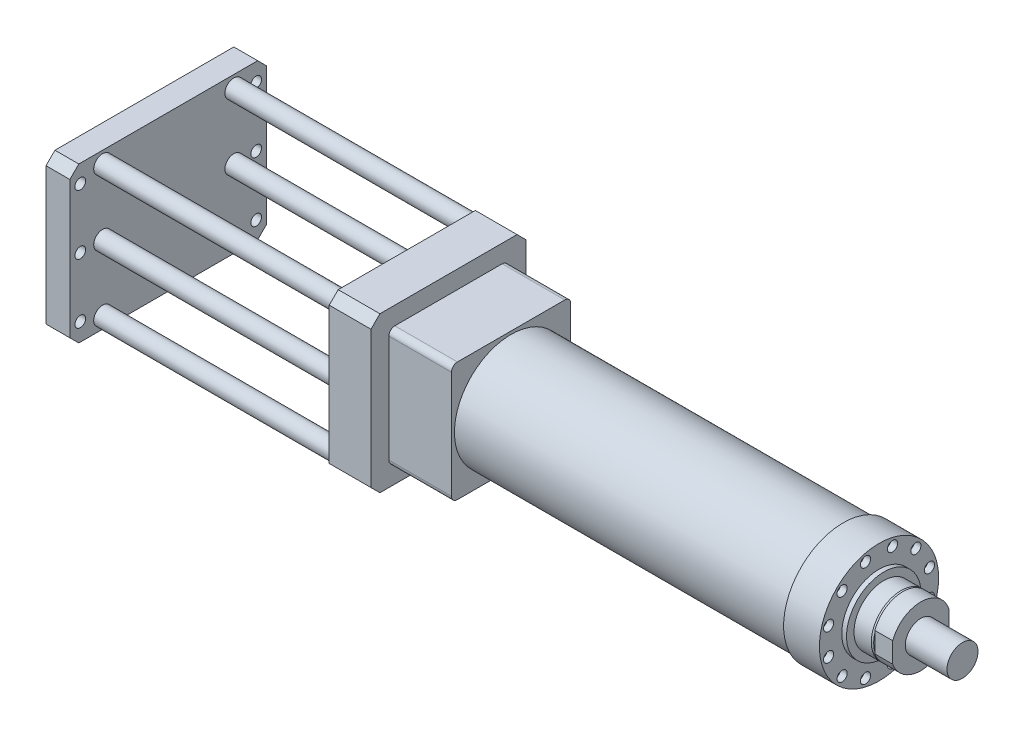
ISO-10303-21;
HEADER;
FILE_DESCRIPTION(('STEP AP214'),'2;1');
FILE_NAME('part.step','',(''),(''),'','','');
FILE_SCHEMA(('AUTOMOTIVE_DESIGN { 1 0 10303 214 1 1 1 1 }'));
ENDSEC;
DATA;
#1=APPLICATION_CONTEXT('core data for automotive mechanical design processes');
#2=APPLICATION_PROTOCOL_DEFINITION('international standard','automotive_design',2000,#1);
#3=PRODUCT_CONTEXT('',#1,'mechanical');
#4=PRODUCT('Part','Part','',(#3));
#5=PRODUCT_RELATED_PRODUCT_CATEGORY('part','',(#4));
#6=PRODUCT_DEFINITION_FORMATION('','',#4);
#7=PRODUCT_DEFINITION_CONTEXT('part definition',#1,'design');
#8=PRODUCT_DEFINITION('design','',#6,#7);
#9=PRODUCT_DEFINITION_SHAPE('','',#8);
#10=(LENGTH_UNIT() NAMED_UNIT(*) SI_UNIT(.MILLI.,.METRE.));
#11=(NAMED_UNIT(*) PLANE_ANGLE_UNIT() SI_UNIT($,.RADIAN.));
#12=(NAMED_UNIT(*) SI_UNIT($,.STERADIAN.) SOLID_ANGLE_UNIT());
#13=UNCERTAINTY_MEASURE_WITH_UNIT(LENGTH_MEASURE(1.E-05),#10,'distance_accuracy_value','');
#14=(GEOMETRIC_REPRESENTATION_CONTEXT(3) GLOBAL_UNCERTAINTY_ASSIGNED_CONTEXT((#13)) GLOBAL_UNIT_ASSIGNED_CONTEXT((#10,
#11,#12)) REPRESENTATION_CONTEXT('',''));
#15=CARTESIAN_POINT('',(0.,0.,0.));
#16=DIRECTION('',(0.,0.,1.));
#17=DIRECTION('',(1.,0.,0.));
#18=AXIS2_PLACEMENT_3D('',#15,#16,#17);
#19=CARTESIAN_POINT('',(-615.,0.,0.));
#20=DIRECTION('',(-1.,0.,0.));
#21=DIRECTION('',(0.,0.,1.));
#22=AXIS2_PLACEMENT_3D('',#19,#20,#21);
#23=PLANE('',#22);
#24=CARTESIAN_POINT('',(-615.,0.,147.5));
#25=DIRECTION('',(-1.,0.,0.));
#26=DIRECTION('',(0.,0.,-1.));
#27=AXIS2_PLACEMENT_3D('',#24,#25,#26);
#28=CIRCLE('',#27,9.00000000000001);
#29=CARTESIAN_POINT('',(-615.,0.,138.5));
#30=VERTEX_POINT('',#29);
#31=EDGE_CURVE('E214',#30,#30,#28,.T.);
#32=ORIENTED_EDGE('',*,*,#31,.F.);
#33=EDGE_LOOP('',(#32));
#34=FACE_BOUND('',#33,.T.);
#35=CARTESIAN_POINT('',(-615.,-100.,-147.5));
#36=DIRECTION('',(-1.,0.,0.));
#37=DIRECTION('',(0.,0.,1.));
#38=AXIS2_PLACEMENT_3D('',#35,#36,#37);
#39=CIRCLE('',#38,9.00000000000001);
#40=CARTESIAN_POINT('',(-615.,-100.,-138.5));
#41=VERTEX_POINT('',#40);
#42=EDGE_CURVE('E202',#41,#41,#39,.T.);
#43=ORIENTED_EDGE('',*,*,#42,.F.);
#44=EDGE_LOOP('',(#43));
#45=FACE_BOUND('',#44,.T.);
#46=CARTESIAN_POINT('',(-615.,100.,-147.5));
#47=DIRECTION('',(-1.,0.,0.));
#48=DIRECTION('',(0.,0.,1.));
#49=AXIS2_PLACEMENT_3D('',#46,#47,#48);
#50=CIRCLE('',#49,9.00000000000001);
#51=CARTESIAN_POINT('',(-615.,100.,-138.5));
#52=VERTEX_POINT('',#51);
#53=EDGE_CURVE('E188',#52,#52,#50,.T.);
#54=ORIENTED_EDGE('',*,*,#53,.F.);
#55=EDGE_LOOP('',(#54));
#56=FACE_BOUND('',#55,.T.);
#57=DIRECTION('',(0.,0.,-1.));
#58=VECTOR('',#57,1.);
#59=CARTESIAN_POINT('',(-615.,130.,-165.));
#60=LINE('',#59,#58);
#61=CARTESIAN_POINT('',(-615.,130.,150.));
#62=VERTEX_POINT('',#61);
#63=CARTESIAN_POINT('',(-615.,130.,-150.));
#64=VERTEX_POINT('',#63);
#65=EDGE_CURVE('E183',#62,#64,#60,.T.);
#66=ORIENTED_EDGE('',*,*,#65,.T.);
#67=DIRECTION('',(0.,0.707106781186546,0.707106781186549));
#68=VECTOR('',#67,1.);
#69=CARTESIAN_POINT('',(-615.,140.,-140.));
#70=LINE('',#69,#68);
#71=CARTESIAN_POINT('',(-615.,115.,-165.));
#72=VERTEX_POINT('',#71);
#73=EDGE_CURVE('E164',#64,#72,#70,.F.);
#74=ORIENTED_EDGE('',*,*,#73,.T.);
#75=DIRECTION('',(0.,-1.,0.));
#76=VECTOR('',#75,1.);
#77=CARTESIAN_POINT('',(-615.,130.,-165.));
#78=LINE('',#77,#76);
#79=CARTESIAN_POINT('',(-615.,-115.,-165.));
#80=VERTEX_POINT('',#79);
#81=EDGE_CURVE('E134',#72,#80,#78,.T.);
#82=ORIENTED_EDGE('',*,*,#81,.T.);
#83=DIRECTION('',(0.,0.707106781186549,-0.707106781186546));
#84=VECTOR('',#83,1.);
#85=CARTESIAN_POINT('',(-615.,-140.,-140.));
#86=LINE('',#85,#84);
#87=CARTESIAN_POINT('',(-615.,-130.,-150.));
#88=VERTEX_POINT('',#87);
#89=EDGE_CURVE('E70',#80,#88,#86,.F.);
#90=ORIENTED_EDGE('',*,*,#89,.T.);
#91=DIRECTION('',(0.,0.,1.));
#92=VECTOR('',#91,1.);
#93=CARTESIAN_POINT('',(-615.,-130.,-165.));
#94=LINE('',#93,#92);
#95=CARTESIAN_POINT('',(-615.,-130.,150.));
#96=VERTEX_POINT('',#95);
#97=EDGE_CURVE('E150',#88,#96,#94,.T.);
#98=ORIENTED_EDGE('',*,*,#97,.T.);
#99=DIRECTION('',(0.,-0.707106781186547,-0.707106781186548));
#100=VECTOR('',#99,1.);
#101=CARTESIAN_POINT('',(-615.,-140.,140.));
#102=LINE('',#101,#100);
#103=CARTESIAN_POINT('',(-615.,-115.,165.));
#104=VERTEX_POINT('',#103);
#105=EDGE_CURVE('E161',#96,#104,#102,.F.);
#106=ORIENTED_EDGE('',*,*,#105,.T.);
#107=DIRECTION('',(0.,1.,0.));
#108=VECTOR('',#107,1.);
#109=CARTESIAN_POINT('',(-615.,130.,165.));
#110=LINE('',#109,#108);
#111=CARTESIAN_POINT('',(-615.,115.,165.));
#112=VERTEX_POINT('',#111);
#113=EDGE_CURVE('E144',#104,#112,#110,.T.);
#114=ORIENTED_EDGE('',*,*,#113,.T.);
#115=DIRECTION('',(0.,-0.707106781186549,0.707106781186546));
#116=VECTOR('',#115,1.);
#117=CARTESIAN_POINT('',(-615.,140.,140.));
#118=LINE('',#117,#116);
#119=EDGE_CURVE('E159',#112,#62,#118,.F.);
#120=ORIENTED_EDGE('',*,*,#119,.T.);
#121=EDGE_LOOP('',(#66,#74,#82,#90,#98,#106,#114,#120));
#122=FACE_BOUND('',#121,.T.);
#123=CARTESIAN_POINT('',(-615.,0.,-147.5));
#124=DIRECTION('',(-1.,0.,0.));
#125=DIRECTION('',(0.,0.,1.));
#126=AXIS2_PLACEMENT_3D('',#123,#124,#125);
#127=CIRCLE('',#126,9.00000000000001);
#128=CARTESIAN_POINT('',(-615.,0.,-138.5));
#129=VERTEX_POINT('',#128);
#130=EDGE_CURVE('E197',#129,#129,#127,.T.);
#131=ORIENTED_EDGE('',*,*,#130,.F.);
#132=EDGE_LOOP('',(#131));
#133=FACE_BOUND('',#132,.T.);
#134=CARTESIAN_POINT('',(-615.,-100.,147.5));
#135=DIRECTION('',(-1.,0.,0.));
#136=DIRECTION('',(0.,0.,-1.));
#137=AXIS2_PLACEMENT_3D('',#134,#135,#136);
#138=CIRCLE('',#137,9.00000000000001);
#139=CARTESIAN_POINT('',(-615.,-100.,138.5));
#140=VERTEX_POINT('',#139);
#141=EDGE_CURVE('E208',#140,#140,#138,.T.);
#142=ORIENTED_EDGE('',*,*,#141,.F.);
#143=EDGE_LOOP('',(#142));
#144=FACE_BOUND('',#143,.T.);
#145=CARTESIAN_POINT('',(-615.,100.,147.5));
#146=DIRECTION('',(-1.,0.,0.));
#147=DIRECTION('',(0.,0.,-1.));
#148=AXIS2_PLACEMENT_3D('',#145,#146,#147);
#149=CIRCLE('',#148,9.00000000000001);
#150=CARTESIAN_POINT('',(-615.,100.,138.5));
#151=VERTEX_POINT('',#150);
#152=EDGE_CURVE('E220',#151,#151,#149,.T.);
#153=ORIENTED_EDGE('',*,*,#152,.F.);
#154=EDGE_LOOP('',(#153));
#155=FACE_BOUND('',#154,.T.);
#156=ADVANCED_FACE('F48',(#34,#45,#56,#122,#133,#144,#155),#23,.T.);
#157=CARTESIAN_POINT('',(-575.,0.,0.));
#158=DIRECTION('',(-1.,0.,0.));
#159=DIRECTION('',(0.,0.,1.));
#160=AXIS2_PLACEMENT_3D('',#157,#158,#159);
#161=PLANE('',#160);
#162=DIRECTION('',(0.,-1.,0.));
#163=VECTOR('',#162,1.);
#164=CARTESIAN_POINT('',(-575.,130.,-165.));
#165=LINE('',#164,#163);
#166=CARTESIAN_POINT('',(-575.,115.,-165.));
#167=VERTEX_POINT('',#166);
#168=CARTESIAN_POINT('',(-575.,-115.,-165.));
#169=VERTEX_POINT('',#168);
#170=EDGE_CURVE('E132',#167,#169,#165,.T.);
#171=ORIENTED_EDGE('',*,*,#170,.F.);
#172=DIRECTION('',(0.,-0.707106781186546,-0.707106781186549));
#173=VECTOR('',#172,1.);
#174=CARTESIAN_POINT('',(-575.,115.,-165.));
#175=LINE('',#174,#173);
#176=CARTESIAN_POINT('',(-575.,130.,-150.));
#177=VERTEX_POINT('',#176);
#178=EDGE_CURVE('E115',#167,#177,#175,.F.);
#179=ORIENTED_EDGE('',*,*,#178,.T.);
#180=DIRECTION('',(0.,0.,-1.));
#181=VECTOR('',#180,1.);
#182=CARTESIAN_POINT('',(-575.,130.,-165.));
#183=LINE('',#182,#181);
#184=CARTESIAN_POINT('',(-575.,130.,150.));
#185=VERTEX_POINT('',#184);
#186=EDGE_CURVE('E142',#185,#177,#183,.T.);
#187=ORIENTED_EDGE('',*,*,#186,.F.);
#188=DIRECTION('',(0.,0.707106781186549,-0.707106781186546));
#189=VECTOR('',#188,1.);
#190=CARTESIAN_POINT('',(-575.,130.,150.));
#191=LINE('',#190,#189);
#192=CARTESIAN_POINT('',(-575.,115.,165.));
#193=VERTEX_POINT('',#192);
#194=EDGE_CURVE('E135',#185,#193,#191,.F.);
#195=ORIENTED_EDGE('',*,*,#194,.T.);
#196=DIRECTION('',(0.,1.,0.));
#197=VECTOR('',#196,1.);
#198=CARTESIAN_POINT('',(-575.,130.,165.));
#199=LINE('',#198,#197);
#200=CARTESIAN_POINT('',(-575.,-115.,165.));
#201=VERTEX_POINT('',#200);
#202=EDGE_CURVE('E146',#201,#193,#199,.T.);
#203=ORIENTED_EDGE('',*,*,#202,.F.);
#204=DIRECTION('',(0.,0.707106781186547,0.707106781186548));
#205=VECTOR('',#204,1.);
#206=CARTESIAN_POINT('',(-575.,-115.,165.));
#207=LINE('',#206,#205);
#208=CARTESIAN_POINT('',(-575.,-130.,150.));
#209=VERTEX_POINT('',#208);
#210=EDGE_CURVE('E153',#201,#209,#207,.F.);
#211=ORIENTED_EDGE('',*,*,#210,.T.);
#212=DIRECTION('',(0.,0.,1.));
#213=VECTOR('',#212,1.);
#214=CARTESIAN_POINT('',(-575.,-130.,-165.));
#215=LINE('',#214,#213);
#216=CARTESIAN_POINT('',(-575.,-130.,-150.));
#217=VERTEX_POINT('',#216);
#218=EDGE_CURVE('E141',#217,#209,#215,.T.);
#219=ORIENTED_EDGE('',*,*,#218,.F.);
#220=DIRECTION('',(0.,-0.707106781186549,0.707106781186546));
#221=VECTOR('',#220,1.);
#222=CARTESIAN_POINT('',(-575.,-130.,-150.));
#223=LINE('',#222,#221);
#224=EDGE_CURVE('E126',#217,#169,#223,.F.);
#225=ORIENTED_EDGE('',*,*,#224,.T.);
#226=EDGE_LOOP('',(#171,#179,#187,#195,#203,#211,#219,#225));
#227=FACE_BOUND('',#226,.T.);
#228=CARTESIAN_POINT('',(-575.,100.,-147.5));
#229=DIRECTION('',(-1.,0.,0.));
#230=DIRECTION('',(0.,0.,1.));
#231=AXIS2_PLACEMENT_3D('',#228,#229,#230);
#232=CIRCLE('',#231,9.00000000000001);
#233=CARTESIAN_POINT('',(-575.,100.,-138.5));
#234=VERTEX_POINT('',#233);
#235=EDGE_CURVE('E190',#234,#234,#232,.T.);
#236=ORIENTED_EDGE('',*,*,#235,.T.);
#237=EDGE_LOOP('',(#236));
#238=FACE_BOUND('',#237,.T.);
#239=CARTESIAN_POINT('',(-575.,0.,-147.5));
#240=DIRECTION('',(-1.,0.,0.));
#241=DIRECTION('',(0.,0.,1.));
#242=AXIS2_PLACEMENT_3D('',#239,#240,#241);
#243=CIRCLE('',#242,9.00000000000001);
#244=CARTESIAN_POINT('',(-575.,0.,-138.5));
#245=VERTEX_POINT('',#244);
#246=EDGE_CURVE('E199',#245,#245,#243,.T.);
#247=ORIENTED_EDGE('',*,*,#246,.T.);
#248=EDGE_LOOP('',(#247));
#249=FACE_BOUND('',#248,.T.);
#250=CARTESIAN_POINT('',(-575.,-100.,-147.5));
#251=DIRECTION('',(-1.,0.,0.));
#252=DIRECTION('',(0.,0.,1.));
#253=AXIS2_PLACEMENT_3D('',#250,#251,#252);
#254=CIRCLE('',#253,9.00000000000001);
#255=CARTESIAN_POINT('',(-575.,-100.,-138.5));
#256=VERTEX_POINT('',#255);
#257=EDGE_CURVE('E205',#256,#256,#254,.T.);
#258=ORIENTED_EDGE('',*,*,#257,.T.);
#259=EDGE_LOOP('',(#258));
#260=FACE_BOUND('',#259,.T.);
#261=CARTESIAN_POINT('',(-575.,-100.,147.5));
#262=DIRECTION('',(-1.,0.,0.));
#263=DIRECTION('',(0.,0.,-1.));
#264=AXIS2_PLACEMENT_3D('',#261,#262,#263);
#265=CIRCLE('',#264,9.00000000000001);
#266=CARTESIAN_POINT('',(-575.,-100.,138.5));
#267=VERTEX_POINT('',#266);
#268=EDGE_CURVE('E211',#267,#267,#265,.T.);
#269=ORIENTED_EDGE('',*,*,#268,.T.);
#270=EDGE_LOOP('',(#269));
#271=FACE_BOUND('',#270,.T.);
#272=CARTESIAN_POINT('',(-575.,0.,147.5));
#273=DIRECTION('',(-1.,0.,0.));
#274=DIRECTION('',(0.,0.,-1.));
#275=AXIS2_PLACEMENT_3D('',#272,#273,#274);
#276=CIRCLE('',#275,9.00000000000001);
#277=CARTESIAN_POINT('',(-575.,0.,138.5));
#278=VERTEX_POINT('',#277);
#279=EDGE_CURVE('E217',#278,#278,#276,.T.);
#280=ORIENTED_EDGE('',*,*,#279,.T.);
#281=EDGE_LOOP('',(#280));
#282=FACE_BOUND('',#281,.T.);
#283=CARTESIAN_POINT('',(-575.,100.,147.5));
#284=DIRECTION('',(-1.,0.,0.));
#285=DIRECTION('',(0.,0.,-1.));
#286=AXIS2_PLACEMENT_3D('',#283,#284,#285);
#287=CIRCLE('',#286,9.00000000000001);
#288=CARTESIAN_POINT('',(-575.,100.,138.5));
#289=VERTEX_POINT('',#288);
#290=EDGE_CURVE('E223',#289,#289,#287,.T.);
#291=ORIENTED_EDGE('',*,*,#290,.T.);
#292=EDGE_LOOP('',(#291));
#293=FACE_BOUND('',#292,.T.);
#294=ADVANCED_FACE('F138',(#227,#238,#249,#260,#271,#282,#293),#161,.F.);
#295=CARTESIAN_POINT('',(-615.,130.,165.));
#296=DIRECTION('',(0.,0.,-1.));
#297=DIRECTION('',(0.,1.,0.));
#298=AXIS2_PLACEMENT_3D('',#295,#296,#297);
#299=PLANE('',#298);
#300=ORIENTED_EDGE('',*,*,#113,.F.);
#301=DIRECTION('',(1.,0.,0.));
#302=VECTOR('',#301,1.);
#303=CARTESIAN_POINT('',(-615.,-115.,165.));
#304=LINE('',#303,#302);
#305=EDGE_CURVE('E12',#104,#201,#304,.T.);
#306=ORIENTED_EDGE('',*,*,#305,.T.);
#307=ORIENTED_EDGE('',*,*,#202,.T.);
#308=DIRECTION('',(-1.,0.,0.));
#309=VECTOR('',#308,1.);
#310=CARTESIAN_POINT('',(-615.,115.,165.));
#311=LINE('',#310,#309);
#312=EDGE_CURVE('E56',#193,#112,#311,.T.);
#313=ORIENTED_EDGE('',*,*,#312,.T.);
#314=EDGE_LOOP('',(#300,#306,#307,#313));
#315=FACE_BOUND('',#314,.T.);
#316=ADVANCED_FACE('F174',(#315),#299,.F.);
#317=CARTESIAN_POINT('',(-615.,130.,-165.));
#318=DIRECTION('',(0.,-1.,0.));
#319=DIRECTION('',(0.,0.,-1.));
#320=AXIS2_PLACEMENT_3D('',#317,#318,#319);
#321=PLANE('',#320);
#322=ORIENTED_EDGE('',*,*,#186,.T.);
#323=DIRECTION('',(-1.,0.,0.));
#324=VECTOR('',#323,1.);
#325=CARTESIAN_POINT('',(-615.,130.,-150.));
#326=LINE('',#325,#324);
#327=EDGE_CURVE('E120',#177,#64,#326,.T.);
#328=ORIENTED_EDGE('',*,*,#327,.T.);
#329=ORIENTED_EDGE('',*,*,#65,.F.);
#330=DIRECTION('',(1.,0.,0.));
#331=VECTOR('',#330,1.);
#332=CARTESIAN_POINT('',(-615.,130.,150.));
#333=LINE('',#332,#331);
#334=EDGE_CURVE('E125',#62,#185,#333,.T.);
#335=ORIENTED_EDGE('',*,*,#334,.T.);
#336=EDGE_LOOP('',(#322,#328,#329,#335));
#337=FACE_BOUND('',#336,.T.);
#338=ADVANCED_FACE('F187',(#337),#321,.F.);
#339=CARTESIAN_POINT('',(-615.,130.,-165.));
#340=DIRECTION('',(0.,0.,1.));
#341=DIRECTION('',(1.,0.,0.));
#342=AXIS2_PLACEMENT_3D('',#339,#340,#341);
#343=PLANE('',#342);
#344=ORIENTED_EDGE('',*,*,#81,.F.);
#345=DIRECTION('',(1.,0.,0.));
#346=VECTOR('',#345,1.);
#347=CARTESIAN_POINT('',(-615.,115.,-165.));
#348=LINE('',#347,#346);
#349=EDGE_CURVE('E119',#72,#167,#348,.T.);
#350=ORIENTED_EDGE('',*,*,#349,.T.);
#351=ORIENTED_EDGE('',*,*,#170,.T.);
#352=DIRECTION('',(-1.,0.,0.));
#353=VECTOR('',#352,1.);
#354=CARTESIAN_POINT('',(-615.,-115.,-165.));
#355=LINE('',#354,#353);
#356=EDGE_CURVE('E136',#169,#80,#355,.T.);
#357=ORIENTED_EDGE('',*,*,#356,.T.);
#358=EDGE_LOOP('',(#344,#350,#351,#357));
#359=FACE_BOUND('',#358,.T.);
#360=ADVANCED_FACE('F131',(#359),#343,.F.);
#361=CARTESIAN_POINT('',(-615.,-130.,-165.));
#362=DIRECTION('',(0.,1.,0.));
#363=DIRECTION('',(0.,0.,1.));
#364=AXIS2_PLACEMENT_3D('',#361,#362,#363);
#365=PLANE('',#364);
#366=ORIENTED_EDGE('',*,*,#97,.F.);
#367=DIRECTION('',(1.,0.,0.));
#368=VECTOR('',#367,1.);
#369=CARTESIAN_POINT('',(-615.,-130.,-150.));
#370=LINE('',#369,#368);
#371=EDGE_CURVE('E167',#88,#217,#370,.T.);
#372=ORIENTED_EDGE('',*,*,#371,.T.);
#373=ORIENTED_EDGE('',*,*,#218,.T.);
#374=DIRECTION('',(-1.,0.,0.));
#375=VECTOR('',#374,1.);
#376=CARTESIAN_POINT('',(-615.,-130.,150.));
#377=LINE('',#376,#375);
#378=EDGE_CURVE('E63',#209,#96,#377,.T.);
#379=ORIENTED_EDGE('',*,*,#378,.T.);
#380=EDGE_LOOP('',(#366,#372,#373,#379));
#381=FACE_BOUND('',#380,.T.);
#382=ADVANCED_FACE('F245',(#381),#365,.F.);
#383=CARTESIAN_POINT('',(-615.,100.,-147.5));
#384=DIRECTION('',(1.,0.,0.));
#385=DIRECTION('',(0.,0.,-1.));
#386=AXIS2_PLACEMENT_3D('',#383,#384,#385);
#387=CYLINDRICAL_SURFACE('',#386,9.00000000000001);
#388=ORIENTED_EDGE('',*,*,#53,.T.);
#389=EDGE_LOOP('',(#388));
#390=FACE_BOUND('',#389,.T.);
#391=ORIENTED_EDGE('',*,*,#235,.F.);
#392=EDGE_LOOP('',(#391));
#393=FACE_BOUND('',#392,.T.);
#394=ADVANCED_FACE('F242',(#390,#393),#387,.F.);
#395=CARTESIAN_POINT('',(-615.,0.,-147.5));
#396=DIRECTION('',(1.,0.,0.));
#397=DIRECTION('',(0.,0.,-1.));
#398=AXIS2_PLACEMENT_3D('',#395,#396,#397);
#399=CYLINDRICAL_SURFACE('',#398,9.00000000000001);
#400=ORIENTED_EDGE('',*,*,#130,.T.);
#401=EDGE_LOOP('',(#400));
#402=FACE_BOUND('',#401,.T.);
#403=ORIENTED_EDGE('',*,*,#246,.F.);
#404=EDGE_LOOP('',(#403));
#405=FACE_BOUND('',#404,.T.);
#406=ADVANCED_FACE('F357',(#402,#405),#399,.F.);
#407=CARTESIAN_POINT('',(-615.,-100.,-147.5));
#408=DIRECTION('',(1.,0.,0.));
#409=DIRECTION('',(0.,0.,-1.));
#410=AXIS2_PLACEMENT_3D('',#407,#408,#409);
#411=CYLINDRICAL_SURFACE('',#410,9.00000000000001);
#412=ORIENTED_EDGE('',*,*,#42,.T.);
#413=EDGE_LOOP('',(#412));
#414=FACE_BOUND('',#413,.T.);
#415=ORIENTED_EDGE('',*,*,#257,.F.);
#416=EDGE_LOOP('',(#415));
#417=FACE_BOUND('',#416,.T.);
#418=ADVANCED_FACE('F347',(#414,#417),#411,.F.);
#419=CARTESIAN_POINT('',(-615.,-100.,147.5));
#420=DIRECTION('',(1.,0.,0.));
#421=DIRECTION('',(0.,0.,-1.));
#422=AXIS2_PLACEMENT_3D('',#419,#420,#421);
#423=CYLINDRICAL_SURFACE('',#422,9.00000000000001);
#424=ORIENTED_EDGE('',*,*,#141,.T.);
#425=EDGE_LOOP('',(#424));
#426=FACE_BOUND('',#425,.T.);
#427=ORIENTED_EDGE('',*,*,#268,.F.);
#428=EDGE_LOOP('',(#427));
#429=FACE_BOUND('',#428,.T.);
#430=ADVANCED_FACE('F337',(#426,#429),#423,.F.);
#431=CARTESIAN_POINT('',(-615.,0.,147.5));
#432=DIRECTION('',(1.,0.,0.));
#433=DIRECTION('',(0.,0.,-1.));
#434=AXIS2_PLACEMENT_3D('',#431,#432,#433);
#435=CYLINDRICAL_SURFACE('',#434,9.00000000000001);
#436=ORIENTED_EDGE('',*,*,#31,.T.);
#437=EDGE_LOOP('',(#436));
#438=FACE_BOUND('',#437,.T.);
#439=ORIENTED_EDGE('',*,*,#279,.F.);
#440=EDGE_LOOP('',(#439));
#441=FACE_BOUND('',#440,.T.);
#442=ADVANCED_FACE('F328',(#438,#441),#435,.F.);
#443=CARTESIAN_POINT('',(-615.,100.,147.5));
#444=DIRECTION('',(1.,0.,0.));
#445=DIRECTION('',(0.,0.,-1.));
#446=AXIS2_PLACEMENT_3D('',#443,#444,#445);
#447=CYLINDRICAL_SURFACE('',#446,9.00000000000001);
#448=ORIENTED_EDGE('',*,*,#152,.T.);
#449=EDGE_LOOP('',(#448));
#450=FACE_BOUND('',#449,.T.);
#451=ORIENTED_EDGE('',*,*,#290,.F.);
#452=EDGE_LOOP('',(#451));
#453=FACE_BOUND('',#452,.T.);
#454=ADVANCED_FACE('F229',(#450,#453),#447,.F.);
#455=CARTESIAN_POINT('',(-615.,115.,-165.));
#456=DIRECTION('',(0.,-0.707106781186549,0.707106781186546));
#457=DIRECTION('',(1.,0.,0.));
#458=AXIS2_PLACEMENT_3D('',#455,#456,#457);
#459=PLANE('',#458);
#460=ORIENTED_EDGE('',*,*,#73,.F.);
#461=ORIENTED_EDGE('',*,*,#327,.F.);
#462=ORIENTED_EDGE('',*,*,#178,.F.);
#463=ORIENTED_EDGE('',*,*,#349,.F.);
#464=EDGE_LOOP('',(#460,#461,#462,#463));
#465=FACE_BOUND('',#464,.T.);
#466=ADVANCED_FACE('F118',(#465),#459,.F.);
#467=CARTESIAN_POINT('',(-615.,-130.,-150.));
#468=DIRECTION('',(0.,0.707106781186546,0.707106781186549));
#469=DIRECTION('',(1.,0.,0.));
#470=AXIS2_PLACEMENT_3D('',#467,#468,#469);
#471=PLANE('',#470);
#472=ORIENTED_EDGE('',*,*,#89,.F.);
#473=ORIENTED_EDGE('',*,*,#356,.F.);
#474=ORIENTED_EDGE('',*,*,#224,.F.);
#475=ORIENTED_EDGE('',*,*,#371,.F.);
#476=EDGE_LOOP('',(#472,#473,#474,#475));
#477=FACE_BOUND('',#476,.T.);
#478=ADVANCED_FACE('F256',(#477),#471,.F.);
#479=CARTESIAN_POINT('',(-615.,-115.,165.));
#480=DIRECTION('',(0.,0.707106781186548,-0.707106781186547));
#481=DIRECTION('',(1.,0.,0.));
#482=AXIS2_PLACEMENT_3D('',#479,#480,#481);
#483=PLANE('',#482);
#484=ORIENTED_EDGE('',*,*,#105,.F.);
#485=ORIENTED_EDGE('',*,*,#378,.F.);
#486=ORIENTED_EDGE('',*,*,#210,.F.);
#487=ORIENTED_EDGE('',*,*,#305,.F.);
#488=EDGE_LOOP('',(#484,#485,#486,#487));
#489=FACE_BOUND('',#488,.T.);
#490=ADVANCED_FACE('F258',(#489),#483,.F.);
#491=CARTESIAN_POINT('',(-615.,130.,150.));
#492=DIRECTION('',(0.,-0.707106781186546,-0.707106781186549));
#493=DIRECTION('',(1.,0.,0.));
#494=AXIS2_PLACEMENT_3D('',#491,#492,#493);
#495=PLANE('',#494);
#496=ORIENTED_EDGE('',*,*,#119,.F.);
#497=ORIENTED_EDGE('',*,*,#312,.F.);
#498=ORIENTED_EDGE('',*,*,#194,.F.);
#499=ORIENTED_EDGE('',*,*,#334,.F.);
#500=EDGE_LOOP('',(#496,#497,#498,#499));
#501=FACE_BOUND('',#500,.T.);
#502=ADVANCED_FACE('F50',(#501),#495,.F.);
#503=CLOSED_SHELL('',(#156,#294,#316,#338,#360,#382,#394,#406,#418,#430,#442,#454,#466,#478,
#490,#502));
#504=MANIFOLD_SOLID_BREP('B2',#503);
#505=CARTESIAN_POINT('',(757.,0.,0.));
#506=DIRECTION('',(-1.,0.,0.));
#507=DIRECTION('',(0.,0.,1.));
#508=AXIS2_PLACEMENT_3D('',#505,#506,#507);
#509=CYLINDRICAL_SURFACE('',#508,26.);
#510=CARTESIAN_POINT('',(757.,0.,0.));
#511=DIRECTION('',(1.,0.,0.));
#512=DIRECTION('',(0.,0.,-1.));
#513=AXIS2_PLACEMENT_3D('',#510,#511,#512);
#514=CIRCLE('',#513,26.);
#515=CARTESIAN_POINT('',(757.,0.,-26.));
#516=VERTEX_POINT('',#515);
#517=EDGE_CURVE('E47',#516,#516,#514,.T.);
#518=ORIENTED_EDGE('',*,*,#517,.F.);
#519=EDGE_LOOP('',(#518));
#520=FACE_BOUND('',#519,.T.);
#521=CARTESIAN_POINT('',(687.,0.,0.));
#522=DIRECTION('',(1.,0.,0.));
#523=DIRECTION('',(0.,0.,-1.));
#524=AXIS2_PLACEMENT_3D('',#521,#522,#523);
#525=CIRCLE('',#524,26.);
#526=CARTESIAN_POINT('',(687.,0.,-26.));
#527=VERTEX_POINT('',#526);
#528=EDGE_CURVE('E415',#527,#527,#525,.T.);
#529=ORIENTED_EDGE('',*,*,#528,.T.);
#530=EDGE_LOOP('',(#529));
#531=FACE_BOUND('',#530,.T.);
#532=ADVANCED_FACE('F412',(#520,#531),#509,.T.);
#533=CARTESIAN_POINT('',(757.,0.,0.));
#534=DIRECTION('',(1.,0.,0.));
#535=DIRECTION('',(0.,0.,-1.));
#536=AXIS2_PLACEMENT_3D('',#533,#534,#535);
#537=PLANE('',#536);
#538=ORIENTED_EDGE('',*,*,#517,.T.);
#539=EDGE_LOOP('',(#538));
#540=FACE_BOUND('',#539,.T.);
#541=ADVANCED_FACE('F427',(#540),#537,.T.);
#542=CARTESIAN_POINT('',(687.,0.,0.));
#543=DIRECTION('',(1.,0.,0.));
#544=DIRECTION('',(0.,0.,-1.));
#545=AXIS2_PLACEMENT_3D('',#542,#543,#544);
#546=PLANE('',#545);
#547=ORIENTED_EDGE('',*,*,#528,.F.);
#548=EDGE_LOOP('',(#547));
#549=FACE_BOUND('',#548,.T.);
#550=ADVANCED_FACE('F425',(#549),#546,.F.);
#551=CLOSED_SHELL('',(#532,#541,#550));
#552=MANIFOLD_SOLID_BREP('B6',#551);
#553=CARTESIAN_POINT('',(-175.,130.,130.));
#554=DIRECTION('',(0.,0.,-1.));
#555=DIRECTION('',(0.,1.,0.));
#556=AXIS2_PLACEMENT_3D('',#553,#554,#555);
#557=PLANE('',#556);
#558=DIRECTION('',(0.,1.,0.));
#559=VECTOR('',#558,1.);
#560=CARTESIAN_POINT('',(-175.,130.,130.));
#561=LINE('',#560,#559);
#562=CARTESIAN_POINT('',(-175.,-115.,130.));
#563=VERTEX_POINT('',#562);
#564=CARTESIAN_POINT('',(-175.,115.,130.));
#565=VERTEX_POINT('',#564);
#566=EDGE_CURVE('E557',#563,#565,#561,.T.);
#567=ORIENTED_EDGE('',*,*,#566,.F.);
#568=DIRECTION('',(1.,0.,0.));
#569=VECTOR('',#568,1.);
#570=CARTESIAN_POINT('',(-175.,-115.,130.));
#571=LINE('',#570,#569);
#572=CARTESIAN_POINT('',(-105.,-115.,130.));
#573=VERTEX_POINT('',#572);
#574=EDGE_CURVE('E410',#563,#573,#571,.T.);
#575=ORIENTED_EDGE('',*,*,#574,.T.);
#576=DIRECTION('',(0.,1.,0.));
#577=VECTOR('',#576,1.);
#578=CARTESIAN_POINT('',(-105.,130.,130.));
#579=LINE('',#578,#577);
#580=CARTESIAN_POINT('',(-105.,115.,130.));
#581=VERTEX_POINT('',#580);
#582=EDGE_CURVE('E559',#573,#581,#579,.T.);
#583=ORIENTED_EDGE('',*,*,#582,.T.);
#584=DIRECTION('',(-1.,0.,0.));
#585=VECTOR('',#584,1.);
#586=CARTESIAN_POINT('',(-175.,115.,130.));
#587=LINE('',#586,#585);
#588=EDGE_CURVE('E470',#581,#565,#587,.T.);
#589=ORIENTED_EDGE('',*,*,#588,.T.);
#590=EDGE_LOOP('',(#567,#575,#583,#589));
#591=FACE_BOUND('',#590,.T.);
#592=ADVANCED_FACE('F462',(#591),#557,.F.);
#593=CARTESIAN_POINT('',(-175.,130.,-130.));
#594=DIRECTION('',(0.,-1.,0.));
#595=DIRECTION('',(0.,0.,-1.));
#596=AXIS2_PLACEMENT_3D('',#593,#594,#595);
#597=PLANE('',#596);
#598=DIRECTION('',(0.,0.,-1.));
#599=VECTOR('',#598,1.);
#600=CARTESIAN_POINT('',(-105.,130.,-130.));
#601=LINE('',#600,#599);
#602=CARTESIAN_POINT('',(-105.,130.,115.));
#603=VERTEX_POINT('',#602);
#604=CARTESIAN_POINT('',(-105.,130.,-115.));
#605=VERTEX_POINT('',#604);
#606=EDGE_CURVE('E555',#603,#605,#601,.T.);
#607=ORIENTED_EDGE('',*,*,#606,.T.);
#608=DIRECTION('',(-1.,0.,0.));
#609=VECTOR('',#608,1.);
#610=CARTESIAN_POINT('',(-175.,130.,-115.));
#611=LINE('',#610,#609);
#612=CARTESIAN_POINT('',(-175.,130.,-115.));
#613=VERTEX_POINT('',#612);
#614=EDGE_CURVE('E534',#605,#613,#611,.T.);
#615=ORIENTED_EDGE('',*,*,#614,.T.);
#616=DIRECTION('',(0.,0.,-1.));
#617=VECTOR('',#616,1.);
#618=CARTESIAN_POINT('',(-175.,130.,-130.));
#619=LINE('',#618,#617);
#620=CARTESIAN_POINT('',(-175.,130.,115.));
#621=VERTEX_POINT('',#620);
#622=EDGE_CURVE('E595',#621,#613,#619,.T.);
#623=ORIENTED_EDGE('',*,*,#622,.F.);
#624=DIRECTION('',(1.,0.,0.));
#625=VECTOR('',#624,1.);
#626=CARTESIAN_POINT('',(-175.,130.,115.));
#627=LINE('',#626,#625);
#628=EDGE_CURVE('E539',#621,#603,#627,.T.);
#629=ORIENTED_EDGE('',*,*,#628,.T.);
#630=EDGE_LOOP('',(#607,#615,#623,#629));
#631=FACE_BOUND('',#630,.T.);
#632=ADVANCED_FACE('F599',(#631),#597,.F.);
#633=CARTESIAN_POINT('',(-175.,130.,-130.));
#634=DIRECTION('',(0.,0.,1.));
#635=DIRECTION('',(0.,-1.,0.));
#636=AXIS2_PLACEMENT_3D('',#633,#634,#635);
#637=PLANE('',#636);
#638=DIRECTION('',(0.,-1.,0.));
#639=VECTOR('',#638,1.);
#640=CARTESIAN_POINT('',(-175.,130.,-130.));
#641=LINE('',#640,#639);
#642=CARTESIAN_POINT('',(-175.,115.,-130.));
#643=VERTEX_POINT('',#642);
#644=CARTESIAN_POINT('',(-175.,-115.,-130.));
#645=VERTEX_POINT('',#644);
#646=EDGE_CURVE('E548',#643,#645,#641,.T.);
#647=ORIENTED_EDGE('',*,*,#646,.F.);
#648=DIRECTION('',(1.,0.,0.));
#649=VECTOR('',#648,1.);
#650=CARTESIAN_POINT('',(-175.,115.,-130.));
#651=LINE('',#650,#649);
#652=CARTESIAN_POINT('',(-105.,115.,-130.));
#653=VERTEX_POINT('',#652);
#654=EDGE_CURVE('E533',#643,#653,#651,.T.);
#655=ORIENTED_EDGE('',*,*,#654,.T.);
#656=DIRECTION('',(0.,-1.,0.));
#657=VECTOR('',#656,1.);
#658=CARTESIAN_POINT('',(-105.,130.,-130.));
#659=LINE('',#658,#657);
#660=CARTESIAN_POINT('',(-105.,-115.,-130.));
#661=VERTEX_POINT('',#660);
#662=EDGE_CURVE('E546',#653,#661,#659,.T.);
#663=ORIENTED_EDGE('',*,*,#662,.T.);
#664=DIRECTION('',(-1.,0.,0.));
#665=VECTOR('',#664,1.);
#666=CARTESIAN_POINT('',(-175.,-115.,-130.));
#667=LINE('',#666,#665);
#668=EDGE_CURVE('E550',#661,#645,#667,.T.);
#669=ORIENTED_EDGE('',*,*,#668,.T.);
#670=EDGE_LOOP('',(#647,#655,#663,#669));
#671=FACE_BOUND('',#670,.T.);
#672=ADVANCED_FACE('F545',(#671),#637,.F.);
#673=CARTESIAN_POINT('',(-175.,-130.,-130.));
#674=DIRECTION('',(0.,1.,0.));
#675=DIRECTION('',(0.,0.,1.));
#676=AXIS2_PLACEMENT_3D('',#673,#674,#675);
#677=PLANE('',#676);
#678=DIRECTION('',(0.,0.,1.));
#679=VECTOR('',#678,1.);
#680=CARTESIAN_POINT('',(-175.,-130.,-130.));
#681=LINE('',#680,#679);
#682=CARTESIAN_POINT('',(-175.,-130.,-115.));
#683=VERTEX_POINT('',#682);
#684=CARTESIAN_POINT('',(-175.,-130.,115.));
#685=VERTEX_POINT('',#684);
#686=EDGE_CURVE('E563',#683,#685,#681,.T.);
#687=ORIENTED_EDGE('',*,*,#686,.F.);
#688=DIRECTION('',(1.,0.,0.));
#689=VECTOR('',#688,1.);
#690=CARTESIAN_POINT('',(-175.,-130.,-115.));
#691=LINE('',#690,#689);
#692=CARTESIAN_POINT('',(-105.,-130.,-115.));
#693=VERTEX_POINT('',#692);
#694=EDGE_CURVE('E580',#683,#693,#691,.T.);
#695=ORIENTED_EDGE('',*,*,#694,.T.);
#696=DIRECTION('',(0.,0.,1.));
#697=VECTOR('',#696,1.);
#698=CARTESIAN_POINT('',(-105.,-130.,-130.));
#699=LINE('',#698,#697);
#700=CARTESIAN_POINT('',(-105.,-130.,115.));
#701=VERTEX_POINT('',#700);
#702=EDGE_CURVE('E554',#693,#701,#699,.T.);
#703=ORIENTED_EDGE('',*,*,#702,.T.);
#704=DIRECTION('',(-1.,0.,0.));
#705=VECTOR('',#704,1.);
#706=CARTESIAN_POINT('',(-175.,-130.,115.));
#707=LINE('',#706,#705);
#708=EDGE_CURVE('E477',#701,#685,#707,.T.);
#709=ORIENTED_EDGE('',*,*,#708,.T.);
#710=EDGE_LOOP('',(#687,#695,#703,#709));
#711=FACE_BOUND('',#710,.T.);
#712=ADVANCED_FACE('F688',(#711),#677,.F.);
#713=CARTESIAN_POINT('',(-175.,0.,0.));
#714=DIRECTION('',(-1.,0.,0.));
#715=DIRECTION('',(0.,0.,1.));
#716=AXIS2_PLACEMENT_3D('',#713,#714,#715);
#717=PLANE('',#716);
#718=CARTESIAN_POINT('',(-175.,0.,110.));
#719=DIRECTION('',(-1.,0.,0.));
#720=DIRECTION('',(0.,0.,1.));
#721=AXIS2_PLACEMENT_3D('',#718,#719,#720);
#722=CIRCLE('',#721,15.);
#723=CARTESIAN_POINT('',(-175.,0.,125.));
#724=VERTEX_POINT('',#723);
#725=EDGE_CURVE('E671',#724,#724,#722,.T.);
#726=ORIENTED_EDGE('',*,*,#725,.F.);
#727=EDGE_LOOP('',(#726));
#728=FACE_BOUND('',#727,.T.);
#729=CARTESIAN_POINT('',(-175.,0.,-110.));
#730=DIRECTION('',(-1.,0.,0.));
#731=DIRECTION('',(0.,0.,1.));
#732=AXIS2_PLACEMENT_3D('',#729,#730,#731);
#733=CIRCLE('',#732,15.);
#734=CARTESIAN_POINT('',(-175.,0.,-95.));
#735=VERTEX_POINT('',#734);
#736=EDGE_CURVE('E665',#735,#735,#733,.T.);
#737=ORIENTED_EDGE('',*,*,#736,.F.);
#738=EDGE_LOOP('',(#737));
#739=FACE_BOUND('',#738,.T.);
#740=CARTESIAN_POINT('',(-175.,110.,-110.));
#741=DIRECTION('',(-1.,0.,0.));
#742=DIRECTION('',(0.,0.,-1.));
#743=AXIS2_PLACEMENT_3D('',#740,#741,#742);
#744=CIRCLE('',#743,15.);
#745=CARTESIAN_POINT('',(-175.,110.,-125.));
#746=VERTEX_POINT('',#745);
#747=EDGE_CURVE('E659',#746,#746,#744,.T.);
#748=ORIENTED_EDGE('',*,*,#747,.F.);
#749=EDGE_LOOP('',(#748));
#750=FACE_BOUND('',#749,.T.);
#751=CARTESIAN_POINT('',(-175.,-110.,-110.));
#752=DIRECTION('',(-1.,0.,0.));
#753=DIRECTION('',(0.,0.,-1.));
#754=AXIS2_PLACEMENT_3D('',#751,#752,#753);
#755=CIRCLE('',#754,15.);
#756=CARTESIAN_POINT('',(-175.,-110.,-125.));
#757=VERTEX_POINT('',#756);
#758=EDGE_CURVE('E653',#757,#757,#755,.T.);
#759=ORIENTED_EDGE('',*,*,#758,.F.);
#760=EDGE_LOOP('',(#759));
#761=FACE_BOUND('',#760,.T.);
#762=CARTESIAN_POINT('',(-175.,-110.,110.));
#763=DIRECTION('',(-1.,0.,0.));
#764=DIRECTION('',(0.,0.,1.));
#765=AXIS2_PLACEMENT_3D('',#762,#763,#764);
#766=CIRCLE('',#765,15.);
#767=CARTESIAN_POINT('',(-175.,-110.,125.));
#768=VERTEX_POINT('',#767);
#769=EDGE_CURVE('E647',#768,#768,#766,.T.);
#770=ORIENTED_EDGE('',*,*,#769,.F.);
#771=EDGE_LOOP('',(#770));
#772=FACE_BOUND('',#771,.T.);
#773=CARTESIAN_POINT('',(-175.,110.,110.));
#774=DIRECTION('',(-1.,0.,0.));
#775=DIRECTION('',(0.,0.,1.));
#776=AXIS2_PLACEMENT_3D('',#773,#774,#775);
#777=CIRCLE('',#776,15.);
#778=CARTESIAN_POINT('',(-175.,110.,125.));
#779=VERTEX_POINT('',#778);
#780=EDGE_CURVE('E641',#779,#779,#777,.T.);
#781=ORIENTED_EDGE('',*,*,#780,.F.);
#782=EDGE_LOOP('',(#781));
#783=FACE_BOUND('',#782,.T.);
#784=CARTESIAN_POINT('',(-175.,-58.3363094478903,-58.3363094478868));
#785=DIRECTION('',(-1.,0.,0.));
#786=DIRECTION('',(0.,0.,1.));
#787=AXIS2_PLACEMENT_3D('',#784,#785,#786);
#788=CIRCLE('',#787,5.00000000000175);
#789=CARTESIAN_POINT('',(-175.,-58.3363094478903,-53.336309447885));
#790=VERTEX_POINT('',#789);
#791=EDGE_CURVE('E626',#790,#790,#788,.T.);
#792=ORIENTED_EDGE('',*,*,#791,.F.);
#793=EDGE_LOOP('',(#792));
#794=FACE_BOUND('',#793,.T.);
#795=CARTESIAN_POINT('',(-175.,-58.3363094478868,58.3363094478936));
#796=DIRECTION('',(-1.,0.,0.));
#797=DIRECTION('',(0.,0.,1.));
#798=AXIS2_PLACEMENT_3D('',#795,#796,#797);
#799=CIRCLE('',#798,5.00000000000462);
#800=CARTESIAN_POINT('',(-175.,-58.3363094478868,63.3363094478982));
#801=VERTEX_POINT('',#800);
#802=EDGE_CURVE('E633',#801,#801,#799,.T.);
#803=ORIENTED_EDGE('',*,*,#802,.F.);
#804=EDGE_LOOP('',(#803));
#805=FACE_BOUND('',#804,.T.);
#806=CARTESIAN_POINT('',(-175.,58.3363094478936,58.3363094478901));
#807=DIRECTION('',(-1.,0.,0.));
#808=DIRECTION('',(0.,0.,1.));
#809=AXIS2_PLACEMENT_3D('',#806,#807,#808);
#810=CIRCLE('',#809,5.00000000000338);
#811=CARTESIAN_POINT('',(-175.,58.3363094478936,63.3363094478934));
#812=VERTEX_POINT('',#811);
#813=EDGE_CURVE('E620',#812,#812,#810,.T.);
#814=ORIENTED_EDGE('',*,*,#813,.F.);
#815=EDGE_LOOP('',(#814));
#816=FACE_BOUND('',#815,.T.);
#817=CARTESIAN_POINT('',(-175.,58.3363094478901,-58.3363094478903));
#818=DIRECTION('',(-1.,0.,0.));
#819=DIRECTION('',(0.,0.,1.));
#820=AXIS2_PLACEMENT_3D('',#817,#818,#819);
#821=CIRCLE('',#820,5.);
#822=CARTESIAN_POINT('',(-175.,58.3363094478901,-53.3363094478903));
#823=VERTEX_POINT('',#822);
#824=EDGE_CURVE('E617',#823,#823,#821,.T.);
#825=ORIENTED_EDGE('',*,*,#824,.F.);
#826=EDGE_LOOP('',(#825));
#827=FACE_BOUND('',#826,.T.);
#828=CARTESIAN_POINT('',(-175.,0.,0.));
#829=DIRECTION('',(-1.,0.,0.));
#830=DIRECTION('',(0.,0.,1.));
#831=AXIS2_PLACEMENT_3D('',#828,#829,#830);
#832=CIRCLE('',#831,65.);
#833=CARTESIAN_POINT('',(-175.,0.,65.));
#834=VERTEX_POINT('',#833);
#835=EDGE_CURVE('E602',#834,#834,#832,.T.);
#836=ORIENTED_EDGE('',*,*,#835,.F.);
#837=EDGE_LOOP('',(#836));
#838=FACE_BOUND('',#837,.T.);
#839=ORIENTED_EDGE('',*,*,#622,.T.);
#840=DIRECTION('',(0.,0.707106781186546,0.707106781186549));
#841=VECTOR('',#840,1.);
#842=CARTESIAN_POINT('',(-175.,122.5,-122.5));
#843=LINE('',#842,#841);
#844=EDGE_CURVE('E577',#613,#643,#843,.F.);
#845=ORIENTED_EDGE('',*,*,#844,.T.);
#846=ORIENTED_EDGE('',*,*,#646,.T.);
#847=DIRECTION('',(0.,0.707106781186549,-0.707106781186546));
#848=VECTOR('',#847,1.);
#849=CARTESIAN_POINT('',(-175.,-122.5,-122.5));
#850=LINE('',#849,#848);
#851=EDGE_CURVE('E484',#645,#683,#850,.F.);
#852=ORIENTED_EDGE('',*,*,#851,.T.);
#853=ORIENTED_EDGE('',*,*,#686,.T.);
#854=DIRECTION('',(0.,-0.707106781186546,-0.707106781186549));
#855=VECTOR('',#854,1.);
#856=CARTESIAN_POINT('',(-175.,-122.5,122.5));
#857=LINE('',#856,#855);
#858=EDGE_CURVE('E574',#685,#563,#857,.F.);
#859=ORIENTED_EDGE('',*,*,#858,.T.);
#860=ORIENTED_EDGE('',*,*,#566,.T.);
#861=DIRECTION('',(0.,-0.707106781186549,0.707106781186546));
#862=VECTOR('',#861,1.);
#863=CARTESIAN_POINT('',(-175.,122.5,122.5));
#864=LINE('',#863,#862);
#865=EDGE_CURVE('E572',#565,#621,#864,.F.);
#866=ORIENTED_EDGE('',*,*,#865,.T.);
#867=EDGE_LOOP('',(#839,#845,#846,#852,#853,#859,#860,#866));
#868=FACE_BOUND('',#867,.T.);
#869=ADVANCED_FACE('F592',(#728,#739,#750,#761,#772,#783,#794,#805,#816,#827,#838,#868),#717,.T.);
#870=CARTESIAN_POINT('',(-105.,0.,0.));
#871=DIRECTION('',(-1.,0.,0.));
#872=DIRECTION('',(0.,0.,1.));
#873=AXIS2_PLACEMENT_3D('',#870,#871,#872);
#874=PLANE('',#873);
#875=ORIENTED_EDGE('',*,*,#662,.F.);
#876=DIRECTION('',(0.,-0.707106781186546,-0.707106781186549));
#877=VECTOR('',#876,1.);
#878=CARTESIAN_POINT('',(-105.,115.,-130.));
#879=LINE('',#878,#877);
#880=EDGE_CURVE('E529',#653,#605,#879,.F.);
#881=ORIENTED_EDGE('',*,*,#880,.T.);
#882=ORIENTED_EDGE('',*,*,#606,.F.);
#883=DIRECTION('',(0.,0.707106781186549,-0.707106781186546));
#884=VECTOR('',#883,1.);
#885=CARTESIAN_POINT('',(-105.,130.,115.));
#886=LINE('',#885,#884);
#887=EDGE_CURVE('E549',#603,#581,#886,.F.);
#888=ORIENTED_EDGE('',*,*,#887,.T.);
#889=ORIENTED_EDGE('',*,*,#582,.F.);
#890=DIRECTION('',(0.,0.707106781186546,0.707106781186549));
#891=VECTOR('',#890,1.);
#892=CARTESIAN_POINT('',(-105.,-115.,130.));
#893=LINE('',#892,#891);
#894=EDGE_CURVE('E566',#573,#701,#893,.F.);
#895=ORIENTED_EDGE('',*,*,#894,.T.);
#896=ORIENTED_EDGE('',*,*,#702,.F.);
#897=DIRECTION('',(0.,-0.707106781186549,0.707106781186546));
#898=VECTOR('',#897,1.);
#899=CARTESIAN_POINT('',(-105.,-130.,-115.));
#900=LINE('',#899,#898);
#901=EDGE_CURVE('E540',#693,#661,#900,.F.);
#902=ORIENTED_EDGE('',*,*,#901,.T.);
#903=EDGE_LOOP('',(#875,#881,#882,#888,#889,#895,#896,#902));
#904=FACE_BOUND('',#903,.T.);
#905=ADVANCED_FACE('F552',(#904),#874,.F.);
#906=CARTESIAN_POINT('',(-145.,0.,0.));
#907=DIRECTION('',(-1.,0.,0.));
#908=DIRECTION('',(0.,0.,1.));
#909=AXIS2_PLACEMENT_3D('',#906,#907,#908);
#910=CYLINDRICAL_SURFACE('',#909,65.);
#911=CARTESIAN_POINT('',(-145.,0.,0.));
#912=DIRECTION('',(-1.,0.,0.));
#913=DIRECTION('',(0.,0.,1.));
#914=AXIS2_PLACEMENT_3D('',#911,#912,#913);
#915=CIRCLE('',#914,65.);
#916=CARTESIAN_POINT('',(-145.,0.,65.));
#917=VERTEX_POINT('',#916);
#918=EDGE_CURVE('E600',#917,#917,#915,.T.);
#919=ORIENTED_EDGE('',*,*,#918,.F.);
#920=EDGE_LOOP('',(#919));
#921=FACE_BOUND('',#920,.T.);
#922=ORIENTED_EDGE('',*,*,#835,.T.);
#923=EDGE_LOOP('',(#922));
#924=FACE_BOUND('',#923,.T.);
#925=ADVANCED_FACE('F710',(#921,#924),#910,.F.);
#926=CARTESIAN_POINT('',(-145.,0.,0.));
#927=DIRECTION('',(-1.,0.,0.));
#928=DIRECTION('',(0.,0.,1.));
#929=AXIS2_PLACEMENT_3D('',#926,#927,#928);
#930=PLANE('',#929);
#931=CARTESIAN_POINT('',(-145.,0.,0.));
#932=DIRECTION('',(-1.,0.,0.));
#933=DIRECTION('',(0.,0.,1.));
#934=AXIS2_PLACEMENT_3D('',#931,#932,#933);
#935=CIRCLE('',#934,55.);
#936=CARTESIAN_POINT('',(-145.,0.,55.));
#937=VERTEX_POINT('',#936);
#938=EDGE_CURVE('E611',#937,#937,#935,.T.);
#939=ORIENTED_EDGE('',*,*,#938,.F.);
#940=EDGE_LOOP('',(#939));
#941=FACE_BOUND('',#940,.T.);
#942=ORIENTED_EDGE('',*,*,#918,.T.);
#943=EDGE_LOOP('',(#942));
#944=FACE_BOUND('',#943,.T.);
#945=ADVANCED_FACE('F712',(#941,#944),#930,.T.);
#946=CARTESIAN_POINT('',(-114.,0.,0.));
#947=DIRECTION('',(-1.,0.,0.));
#948=DIRECTION('',(0.,0.,1.));
#949=AXIS2_PLACEMENT_3D('',#946,#947,#948);
#950=CYLINDRICAL_SURFACE('',#949,55.);
#951=CARTESIAN_POINT('',(-114.,0.,0.));
#952=DIRECTION('',(-1.,0.,0.));
#953=DIRECTION('',(0.,0.,1.));
#954=AXIS2_PLACEMENT_3D('',#951,#952,#953);
#955=CIRCLE('',#954,55.);
#956=CARTESIAN_POINT('',(-114.,0.,55.));
#957=VERTEX_POINT('',#956);
#958=EDGE_CURVE('E609',#957,#957,#955,.T.);
#959=ORIENTED_EDGE('',*,*,#958,.F.);
#960=EDGE_LOOP('',(#959));
#961=FACE_BOUND('',#960,.T.);
#962=ORIENTED_EDGE('',*,*,#938,.T.);
#963=EDGE_LOOP('',(#962));
#964=FACE_BOUND('',#963,.T.);
#965=ADVANCED_FACE('F719',(#961,#964),#950,.F.);
#966=CARTESIAN_POINT('',(-114.,0.,0.));
#967=DIRECTION('',(-1.,0.,0.));
#968=DIRECTION('',(0.,0.,1.));
#969=AXIS2_PLACEMENT_3D('',#966,#967,#968);
#970=PLANE('',#969);
#971=ORIENTED_EDGE('',*,*,#958,.T.);
#972=EDGE_LOOP('',(#971));
#973=FACE_BOUND('',#972,.T.);
#974=ADVANCED_FACE('F992',(#973),#970,.T.);
#975=CARTESIAN_POINT('',(-155.,58.3363094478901,-58.3363094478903));
#976=DIRECTION('',(-1.,0.,0.));
#977=DIRECTION('',(0.,0.,1.));
#978=AXIS2_PLACEMENT_3D('',#975,#976,#977);
#979=CYLINDRICAL_SURFACE('',#978,5.);
#980=CARTESIAN_POINT('',(-155.,58.3363094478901,-58.3363094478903));
#981=DIRECTION('',(-1.,0.,0.));
#982=DIRECTION('',(0.,0.,1.));
#983=AXIS2_PLACEMENT_3D('',#980,#981,#982);
#984=CIRCLE('',#983,5.);
#985=CARTESIAN_POINT('',(-155.,58.3363094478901,-53.3363094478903));
#986=VERTEX_POINT('',#985);
#987=EDGE_CURVE('E614',#986,#986,#984,.T.);
#988=ORIENTED_EDGE('',*,*,#987,.F.);
#989=EDGE_LOOP('',(#988));
#990=FACE_BOUND('',#989,.T.);
#991=ORIENTED_EDGE('',*,*,#824,.T.);
#992=EDGE_LOOP('',(#991));
#993=FACE_BOUND('',#992,.T.);
#994=ADVANCED_FACE('F982',(#990,#993),#979,.F.);
#995=CARTESIAN_POINT('',(-155.,58.3363094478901,-58.3363094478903));
#996=DIRECTION('',(-1.,0.,0.));
#997=DIRECTION('',(0.,0.,1.));
#998=AXIS2_PLACEMENT_3D('',#995,#996,#997);
#999=PLANE('',#998);
#1000=ORIENTED_EDGE('',*,*,#987,.T.);
#1001=EDGE_LOOP('',(#1000));
#1002=FACE_BOUND('',#1001,.T.);
#1003=ADVANCED_FACE('F972',(#1002),#999,.T.);
#1004=CARTESIAN_POINT('',(-155.,58.3363094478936,58.3363094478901));
#1005=DIRECTION('',(-1.,0.,0.));
#1006=DIRECTION('',(0.,0.,1.));
#1007=AXIS2_PLACEMENT_3D('',#1004,#1005,#1006);
#1008=CYLINDRICAL_SURFACE('',#1007,5.00000000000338);
#1009=CARTESIAN_POINT('',(-155.,58.3363094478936,58.3363094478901));
#1010=DIRECTION('',(-1.,0.,0.));
#1011=DIRECTION('',(0.,0.,1.));
#1012=AXIS2_PLACEMENT_3D('',#1009,#1010,#1011);
#1013=CIRCLE('',#1012,5.00000000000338);
#1014=CARTESIAN_POINT('',(-155.,58.3363094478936,63.3363094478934));
#1015=VERTEX_POINT('',#1014);
#1016=EDGE_CURVE('E636',#1015,#1015,#1013,.T.);
#1017=ORIENTED_EDGE('',*,*,#1016,.F.);
#1018=EDGE_LOOP('',(#1017));
#1019=FACE_BOUND('',#1018,.T.);
#1020=ORIENTED_EDGE('',*,*,#813,.T.);
#1021=EDGE_LOOP('',(#1020));
#1022=FACE_BOUND('',#1021,.T.);
#1023=ADVANCED_FACE('F962',(#1019,#1022),#1008,.F.);
#1024=CARTESIAN_POINT('',(-155.,58.3363094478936,58.3363094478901));
#1025=DIRECTION('',(-1.,0.,0.));
#1026=DIRECTION('',(0.,0.,1.));
#1027=AXIS2_PLACEMENT_3D('',#1024,#1025,#1026);
#1028=PLANE('',#1027);
#1029=ORIENTED_EDGE('',*,*,#1016,.T.);
#1030=EDGE_LOOP('',(#1029));
#1031=FACE_BOUND('',#1030,.T.);
#1032=ADVANCED_FACE('F952',(#1031),#1028,.T.);
#1033=CARTESIAN_POINT('',(-155.,-58.3363094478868,58.3363094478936));
#1034=DIRECTION('',(-1.,0.,0.));
#1035=DIRECTION('',(0.,0.,1.));
#1036=AXIS2_PLACEMENT_3D('',#1033,#1034,#1035);
#1037=CYLINDRICAL_SURFACE('',#1036,5.00000000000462);
#1038=CARTESIAN_POINT('',(-155.,-58.3363094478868,58.3363094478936));
#1039=DIRECTION('',(-1.,0.,0.));
#1040=DIRECTION('',(0.,0.,1.));
#1041=AXIS2_PLACEMENT_3D('',#1038,#1039,#1040);
#1042=CIRCLE('',#1041,5.00000000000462);
#1043=CARTESIAN_POINT('',(-155.,-58.3363094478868,63.3363094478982));
#1044=VERTEX_POINT('',#1043);
#1045=EDGE_CURVE('E630',#1044,#1044,#1042,.T.);
#1046=ORIENTED_EDGE('',*,*,#1045,.F.);
#1047=EDGE_LOOP('',(#1046));
#1048=FACE_BOUND('',#1047,.T.);
#1049=ORIENTED_EDGE('',*,*,#802,.T.);
#1050=EDGE_LOOP('',(#1049));
#1051=FACE_BOUND('',#1050,.T.);
#1052=ADVANCED_FACE('F942',(#1048,#1051),#1037,.F.);
#1053=CARTESIAN_POINT('',(-155.,-58.3363094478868,58.3363094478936));
#1054=DIRECTION('',(-1.,0.,0.));
#1055=DIRECTION('',(0.,0.,1.));
#1056=AXIS2_PLACEMENT_3D('',#1053,#1054,#1055);
#1057=PLANE('',#1056);
#1058=ORIENTED_EDGE('',*,*,#1045,.T.);
#1059=EDGE_LOOP('',(#1058));
#1060=FACE_BOUND('',#1059,.T.);
#1061=ADVANCED_FACE('F932',(#1060),#1057,.T.);
#1062=CARTESIAN_POINT('',(-155.,-58.3363094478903,-58.3363094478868));
#1063=DIRECTION('',(-1.,0.,0.));
#1064=DIRECTION('',(0.,0.,1.));
#1065=AXIS2_PLACEMENT_3D('',#1062,#1063,#1064);
#1066=CYLINDRICAL_SURFACE('',#1065,5.00000000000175);
#1067=CARTESIAN_POINT('',(-155.,-58.3363094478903,-58.3363094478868));
#1068=DIRECTION('',(-1.,0.,0.));
#1069=DIRECTION('',(0.,0.,1.));
#1070=AXIS2_PLACEMENT_3D('',#1067,#1068,#1069);
#1071=CIRCLE('',#1070,5.00000000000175);
#1072=CARTESIAN_POINT('',(-155.,-58.3363094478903,-53.336309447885));
#1073=VERTEX_POINT('',#1072);
#1074=EDGE_CURVE('E623',#1073,#1073,#1071,.T.);
#1075=ORIENTED_EDGE('',*,*,#1074,.F.);
#1076=EDGE_LOOP('',(#1075));
#1077=FACE_BOUND('',#1076,.T.);
#1078=ORIENTED_EDGE('',*,*,#791,.T.);
#1079=EDGE_LOOP('',(#1078));
#1080=FACE_BOUND('',#1079,.T.);
#1081=ADVANCED_FACE('F922',(#1077,#1080),#1066,.F.);
#1082=CARTESIAN_POINT('',(-155.,-58.3363094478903,-58.3363094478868));
#1083=DIRECTION('',(-1.,0.,0.));
#1084=DIRECTION('',(0.,0.,1.));
#1085=AXIS2_PLACEMENT_3D('',#1082,#1083,#1084);
#1086=PLANE('',#1085);
#1087=ORIENTED_EDGE('',*,*,#1074,.T.);
#1088=EDGE_LOOP('',(#1087));
#1089=FACE_BOUND('',#1088,.T.);
#1090=ADVANCED_FACE('F912',(#1089),#1086,.T.);
#1091=CARTESIAN_POINT('',(-575.,110.,110.));
#1092=DIRECTION('',(1.,0.,0.));
#1093=DIRECTION('',(0.,0.,-1.));
#1094=AXIS2_PLACEMENT_3D('',#1091,#1092,#1093);
#1095=CYLINDRICAL_SURFACE('',#1094,15.);
#1096=CARTESIAN_POINT('',(-575.,110.,110.));
#1097=DIRECTION('',(-1.,0.,0.));
#1098=DIRECTION('',(0.,0.,1.));
#1099=AXIS2_PLACEMENT_3D('',#1096,#1097,#1098);
#1100=CIRCLE('',#1099,15.);
#1101=CARTESIAN_POINT('',(-575.,110.,125.));
#1102=VERTEX_POINT('',#1101);
#1103=EDGE_CURVE('E627',#1102,#1102,#1100,.T.);
#1104=ORIENTED_EDGE('',*,*,#1103,.F.);
#1105=EDGE_LOOP('',(#1104));
#1106=FACE_BOUND('',#1105,.T.);
#1107=ORIENTED_EDGE('',*,*,#780,.T.);
#1108=EDGE_LOOP('',(#1107));
#1109=FACE_BOUND('',#1108,.T.);
#1110=ADVANCED_FACE('F902',(#1106,#1109),#1095,.T.);
#1111=CARTESIAN_POINT('',(-575.,110.,110.));
#1112=DIRECTION('',(-1.,0.,0.));
#1113=DIRECTION('',(0.,0.,1.));
#1114=AXIS2_PLACEMENT_3D('',#1111,#1112,#1113);
#1115=PLANE('',#1114);
#1116=ORIENTED_EDGE('',*,*,#1103,.T.);
#1117=EDGE_LOOP('',(#1116));
#1118=FACE_BOUND('',#1117,.T.);
#1119=ADVANCED_FACE('F892',(#1118),#1115,.T.);
#1120=CARTESIAN_POINT('',(-575.,-110.,110.));
#1121=DIRECTION('',(1.,0.,0.));
#1122=DIRECTION('',(0.,0.,-1.));
#1123=AXIS2_PLACEMENT_3D('',#1120,#1121,#1122);
#1124=CYLINDRICAL_SURFACE('',#1123,15.);
#1125=CARTESIAN_POINT('',(-575.,-110.,110.));
#1126=DIRECTION('',(-1.,0.,0.));
#1127=DIRECTION('',(0.,0.,1.));
#1128=AXIS2_PLACEMENT_3D('',#1125,#1126,#1127);
#1129=CIRCLE('',#1128,15.);
#1130=CARTESIAN_POINT('',(-575.,-110.,125.));
#1131=VERTEX_POINT('',#1130);
#1132=EDGE_CURVE('E644',#1131,#1131,#1129,.T.);
#1133=ORIENTED_EDGE('',*,*,#1132,.F.);
#1134=EDGE_LOOP('',(#1133));
#1135=FACE_BOUND('',#1134,.T.);
#1136=ORIENTED_EDGE('',*,*,#769,.T.);
#1137=EDGE_LOOP('',(#1136));
#1138=FACE_BOUND('',#1137,.T.);
#1139=ADVANCED_FACE('F882',(#1135,#1138),#1124,.T.);
#1140=CARTESIAN_POINT('',(-575.,-110.,110.));
#1141=DIRECTION('',(-1.,0.,0.));
#1142=DIRECTION('',(0.,0.,1.));
#1143=AXIS2_PLACEMENT_3D('',#1140,#1141,#1142);
#1144=PLANE('',#1143);
#1145=ORIENTED_EDGE('',*,*,#1132,.T.);
#1146=EDGE_LOOP('',(#1145));
#1147=FACE_BOUND('',#1146,.T.);
#1148=ADVANCED_FACE('F872',(#1147),#1144,.T.);
#1149=CARTESIAN_POINT('',(-575.,-110.,-110.));
#1150=DIRECTION('',(1.,0.,0.));
#1151=DIRECTION('',(0.,0.,-1.));
#1152=AXIS2_PLACEMENT_3D('',#1149,#1150,#1151);
#1153=CYLINDRICAL_SURFACE('',#1152,15.);
#1154=CARTESIAN_POINT('',(-575.,-110.,-110.));
#1155=DIRECTION('',(-1.,0.,0.));
#1156=DIRECTION('',(0.,0.,-1.));
#1157=AXIS2_PLACEMENT_3D('',#1154,#1155,#1156);
#1158=CIRCLE('',#1157,15.);
#1159=CARTESIAN_POINT('',(-575.,-110.,-125.));
#1160=VERTEX_POINT('',#1159);
#1161=EDGE_CURVE('E650',#1160,#1160,#1158,.T.);
#1162=ORIENTED_EDGE('',*,*,#1161,.F.);
#1163=EDGE_LOOP('',(#1162));
#1164=FACE_BOUND('',#1163,.T.);
#1165=ORIENTED_EDGE('',*,*,#758,.T.);
#1166=EDGE_LOOP('',(#1165));
#1167=FACE_BOUND('',#1166,.T.);
#1168=ADVANCED_FACE('F862',(#1164,#1167),#1153,.T.);
#1169=CARTESIAN_POINT('',(-575.,-110.,-110.));
#1170=DIRECTION('',(1.,0.,0.));
#1171=DIRECTION('',(0.,0.,-1.));
#1172=AXIS2_PLACEMENT_3D('',#1169,#1170,#1171);
#1173=PLANE('',#1172);
#1174=ORIENTED_EDGE('',*,*,#1161,.T.);
#1175=EDGE_LOOP('',(#1174));
#1176=FACE_BOUND('',#1175,.T.);
#1177=ADVANCED_FACE('F852',(#1176),#1173,.F.);
#1178=CARTESIAN_POINT('',(-575.,110.,-110.));
#1179=DIRECTION('',(1.,0.,0.));
#1180=DIRECTION('',(0.,0.,-1.));
#1181=AXIS2_PLACEMENT_3D('',#1178,#1179,#1180);
#1182=CYLINDRICAL_SURFACE('',#1181,15.);
#1183=CARTESIAN_POINT('',(-575.,110.,-110.));
#1184=DIRECTION('',(-1.,0.,0.));
#1185=DIRECTION('',(0.,0.,-1.));
#1186=AXIS2_PLACEMENT_3D('',#1183,#1184,#1185);
#1187=CIRCLE('',#1186,15.);
#1188=CARTESIAN_POINT('',(-575.,110.,-125.));
#1189=VERTEX_POINT('',#1188);
#1190=EDGE_CURVE('E656',#1189,#1189,#1187,.T.);
#1191=ORIENTED_EDGE('',*,*,#1190,.F.);
#1192=EDGE_LOOP('',(#1191));
#1193=FACE_BOUND('',#1192,.T.);
#1194=ORIENTED_EDGE('',*,*,#747,.T.);
#1195=EDGE_LOOP('',(#1194));
#1196=FACE_BOUND('',#1195,.T.);
#1197=ADVANCED_FACE('F842',(#1193,#1196),#1182,.T.);
#1198=CARTESIAN_POINT('',(-575.,110.,-110.));
#1199=DIRECTION('',(1.,0.,0.));
#1200=DIRECTION('',(0.,0.,-1.));
#1201=AXIS2_PLACEMENT_3D('',#1198,#1199,#1200);
#1202=PLANE('',#1201);
#1203=ORIENTED_EDGE('',*,*,#1190,.T.);
#1204=EDGE_LOOP('',(#1203));
#1205=FACE_BOUND('',#1204,.T.);
#1206=ADVANCED_FACE('F832',(#1205),#1202,.F.);
#1207=CARTESIAN_POINT('',(-575.,0.,-110.));
#1208=DIRECTION('',(1.,0.,0.));
#1209=DIRECTION('',(0.,0.,-1.));
#1210=AXIS2_PLACEMENT_3D('',#1207,#1208,#1209);
#1211=CYLINDRICAL_SURFACE('',#1210,15.);
#1212=CARTESIAN_POINT('',(-575.,0.,-110.));
#1213=DIRECTION('',(-1.,0.,0.));
#1214=DIRECTION('',(0.,0.,1.));
#1215=AXIS2_PLACEMENT_3D('',#1212,#1213,#1214);
#1216=CIRCLE('',#1215,15.);
#1217=CARTESIAN_POINT('',(-575.,0.,-95.));
#1218=VERTEX_POINT('',#1217);
#1219=EDGE_CURVE('E662',#1218,#1218,#1216,.T.);
#1220=ORIENTED_EDGE('',*,*,#1219,.F.);
#1221=EDGE_LOOP('',(#1220));
#1222=FACE_BOUND('',#1221,.T.);
#1223=ORIENTED_EDGE('',*,*,#736,.T.);
#1224=EDGE_LOOP('',(#1223));
#1225=FACE_BOUND('',#1224,.T.);
#1226=ADVANCED_FACE('F822',(#1222,#1225),#1211,.T.);
#1227=CARTESIAN_POINT('',(-575.,0.,-110.));
#1228=DIRECTION('',(-1.,0.,0.));
#1229=DIRECTION('',(0.,0.,1.));
#1230=AXIS2_PLACEMENT_3D('',#1227,#1228,#1229);
#1231=PLANE('',#1230);
#1232=ORIENTED_EDGE('',*,*,#1219,.T.);
#1233=EDGE_LOOP('',(#1232));
#1234=FACE_BOUND('',#1233,.T.);
#1235=ADVANCED_FACE('F682',(#1234),#1231,.T.);
#1236=CARTESIAN_POINT('',(-575.,0.,110.));
#1237=DIRECTION('',(1.,0.,0.));
#1238=DIRECTION('',(0.,0.,-1.));
#1239=AXIS2_PLACEMENT_3D('',#1236,#1237,#1238);
#1240=CYLINDRICAL_SURFACE('',#1239,15.);
#1241=CARTESIAN_POINT('',(-575.,0.,110.));
#1242=DIRECTION('',(-1.,0.,0.));
#1243=DIRECTION('',(0.,0.,1.));
#1244=AXIS2_PLACEMENT_3D('',#1241,#1242,#1243);
#1245=CIRCLE('',#1244,15.);
#1246=CARTESIAN_POINT('',(-575.,0.,125.));
#1247=VERTEX_POINT('',#1246);
#1248=EDGE_CURVE('E668',#1247,#1247,#1245,.T.);
#1249=ORIENTED_EDGE('',*,*,#1248,.F.);
#1250=EDGE_LOOP('',(#1249));
#1251=FACE_BOUND('',#1250,.T.);
#1252=ORIENTED_EDGE('',*,*,#725,.T.);
#1253=EDGE_LOOP('',(#1252));
#1254=FACE_BOUND('',#1253,.T.);
#1255=ADVANCED_FACE('F679',(#1251,#1254),#1240,.T.);
#1256=CARTESIAN_POINT('',(-575.,0.,110.));
#1257=DIRECTION('',(-1.,0.,0.));
#1258=DIRECTION('',(0.,0.,1.));
#1259=AXIS2_PLACEMENT_3D('',#1256,#1257,#1258);
#1260=PLANE('',#1259);
#1261=ORIENTED_EDGE('',*,*,#1248,.T.);
#1262=EDGE_LOOP('',(#1261));
#1263=FACE_BOUND('',#1262,.T.);
#1264=ADVANCED_FACE('F677',(#1263),#1260,.T.);
#1265=CARTESIAN_POINT('',(-175.,115.,-130.));
#1266=DIRECTION('',(0.,-0.707106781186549,0.707106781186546));
#1267=DIRECTION('',(1.,0.,0.));
#1268=AXIS2_PLACEMENT_3D('',#1265,#1266,#1267);
#1269=PLANE('',#1268);
#1270=ORIENTED_EDGE('',*,*,#844,.F.);
#1271=ORIENTED_EDGE('',*,*,#614,.F.);
#1272=ORIENTED_EDGE('',*,*,#880,.F.);
#1273=ORIENTED_EDGE('',*,*,#654,.F.);
#1274=EDGE_LOOP('',(#1270,#1271,#1272,#1273));
#1275=FACE_BOUND('',#1274,.T.);
#1276=ADVANCED_FACE('F532',(#1275),#1269,.F.);
#1277=CARTESIAN_POINT('',(-175.,-130.,-115.));
#1278=DIRECTION('',(0.,0.707106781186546,0.707106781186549));
#1279=DIRECTION('',(1.,0.,0.));
#1280=AXIS2_PLACEMENT_3D('',#1277,#1278,#1279);
#1281=PLANE('',#1280);
#1282=ORIENTED_EDGE('',*,*,#851,.F.);
#1283=ORIENTED_EDGE('',*,*,#668,.F.);
#1284=ORIENTED_EDGE('',*,*,#901,.F.);
#1285=ORIENTED_EDGE('',*,*,#694,.F.);
#1286=EDGE_LOOP('',(#1282,#1283,#1284,#1285));
#1287=FACE_BOUND('',#1286,.T.);
#1288=ADVANCED_FACE('F734',(#1287),#1281,.F.);
#1289=CARTESIAN_POINT('',(-175.,-115.,130.));
#1290=DIRECTION('',(0.,0.707106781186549,-0.707106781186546));
#1291=DIRECTION('',(1.,0.,0.));
#1292=AXIS2_PLACEMENT_3D('',#1289,#1290,#1291);
#1293=PLANE('',#1292);
#1294=ORIENTED_EDGE('',*,*,#858,.F.);
#1295=ORIENTED_EDGE('',*,*,#708,.F.);
#1296=ORIENTED_EDGE('',*,*,#894,.F.);
#1297=ORIENTED_EDGE('',*,*,#574,.F.);
#1298=EDGE_LOOP('',(#1294,#1295,#1296,#1297));
#1299=FACE_BOUND('',#1298,.T.);
#1300=ADVANCED_FACE('F736',(#1299),#1293,.F.);
#1301=CARTESIAN_POINT('',(-175.,130.,115.));
#1302=DIRECTION('',(0.,-0.707106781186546,-0.707106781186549));
#1303=DIRECTION('',(1.,0.,0.));
#1304=AXIS2_PLACEMENT_3D('',#1301,#1302,#1303);
#1305=PLANE('',#1304);
#1306=ORIENTED_EDGE('',*,*,#865,.F.);
#1307=ORIENTED_EDGE('',*,*,#588,.F.);
#1308=ORIENTED_EDGE('',*,*,#887,.F.);
#1309=ORIENTED_EDGE('',*,*,#628,.F.);
#1310=EDGE_LOOP('',(#1306,#1307,#1308,#1309));
#1311=FACE_BOUND('',#1310,.T.);
#1312=ADVANCED_FACE('F464',(#1311),#1305,.F.);
#1313=CLOSED_SHELL('',(#592,#632,#672,#712,#869,#905,#925,#945,#965,#974,#994,#1003,#1023,#1032,
#1052,#1061,#1081,#1090,#1110,#1119,#1139,#1148,#1168,#1177,#1197,#1206,#1226,#1235,#1255,#1264,
#1276,#1288,#1300,#1312));
#1314=MANIFOLD_SOLID_BREP('B42',#1313);
#1315=CARTESIAN_POINT('',(657.,0.,0.));
#1316=DIRECTION('',(1.,0.,0.));
#1317=DIRECTION('',(0.,0.,-1.));
#1318=AXIS2_PLACEMENT_3D('',#1315,#1316,#1317);
#1319=PLANE('',#1318);
#1320=CARTESIAN_POINT('',(657.,0.,0.));
#1321=DIRECTION('',(1.,0.,0.));
#1322=DIRECTION('',(0.,0.,-1.));
#1323=AXIS2_PLACEMENT_3D('',#1320,#1321,#1322);
#1324=CIRCLE('',#1323,48.9080892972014);
#1325=CARTESIAN_POINT('',(657.,-13.5277935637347,-47.));
#1326=VERTEX_POINT('',#1325);
#1327=CARTESIAN_POINT('',(657.,13.5277935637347,-47.));
#1328=VERTEX_POINT('',#1327);
#1329=EDGE_CURVE('E1227',#1326,#1328,#1324,.T.);
#1330=ORIENTED_EDGE('',*,*,#1329,.T.);
#1331=DIRECTION('',(0.,-1.,0.));
#1332=VECTOR('',#1331,1.);
#1333=CARTESIAN_POINT('',(657.,17.058722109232,-47.));
#1334=LINE('',#1333,#1332);
#1335=EDGE_CURVE('E460',#1328,#1326,#1334,.T.);
#1336=ORIENTED_EDGE('',*,*,#1335,.T.);
#1337=EDGE_LOOP('',(#1330,#1336));
#1338=FACE_BOUND('',#1337,.T.);
#1339=ADVANCED_FACE('F1051',(#1338),#1319,.T.);
#1340=CARTESIAN_POINT('',(557.,0.,0.));
#1341=DIRECTION('',(-1.,0.,0.));
#1342=DIRECTION('',(0.,0.,1.));
#1343=AXIS2_PLACEMENT_3D('',#1340,#1341,#1342);
#1344=CYLINDRICAL_SURFACE('',#1343,95.);
#1345=CARTESIAN_POINT('',(557.,0.,0.));
#1346=DIRECTION('',(1.,0.,0.));
#1347=DIRECTION('',(0.,0.,-1.));
#1348=AXIS2_PLACEMENT_3D('',#1345,#1346,#1347);
#1349=CIRCLE('',#1348,95.);
#1350=CARTESIAN_POINT('',(557.,0.,-95.));
#1351=VERTEX_POINT('',#1350);
#1352=EDGE_CURVE('E1306',#1351,#1351,#1349,.T.);
#1353=ORIENTED_EDGE('',*,*,#1352,.F.);
#1354=EDGE_LOOP('',(#1353));
#1355=FACE_BOUND('',#1354,.T.);
#1356=CARTESIAN_POINT('',(0.,0.,0.));
#1357=DIRECTION('',(1.,0.,0.));
#1358=DIRECTION('',(0.,0.,-1.));
#1359=AXIS2_PLACEMENT_3D('',#1356,#1357,#1358);
#1360=CIRCLE('',#1359,95.);
#1361=CARTESIAN_POINT('',(0.,0.,-95.));
#1362=VERTEX_POINT('',#1361);
#1363=EDGE_CURVE('E1179',#1362,#1362,#1360,.T.);
#1364=ORIENTED_EDGE('',*,*,#1363,.T.);
#1365=EDGE_LOOP('',(#1364));
#1366=FACE_BOUND('',#1365,.T.);
#1367=ADVANCED_FACE('F1370',(#1355,#1366),#1344,.T.);
#1368=CARTESIAN_POINT('',(617.,0.,0.));
#1369=DIRECTION('',(-1.,0.,0.));
#1370=DIRECTION('',(0.,0.,1.));
#1371=AXIS2_PLACEMENT_3D('',#1368,#1369,#1370);
#1372=CYLINDRICAL_SURFACE('',#1371,100.);
#1373=CARTESIAN_POINT('',(617.,0.,0.));
#1374=DIRECTION('',(1.,0.,0.));
#1375=DIRECTION('',(0.,0.,-1.));
#1376=AXIS2_PLACEMENT_3D('',#1373,#1374,#1375);
#1377=CIRCLE('',#1376,100.);
#1378=CARTESIAN_POINT('',(617.,0.,-100.));
#1379=VERTEX_POINT('',#1378);
#1380=EDGE_CURVE('E1307',#1379,#1379,#1377,.T.);
#1381=ORIENTED_EDGE('',*,*,#1380,.F.);
#1382=EDGE_LOOP('',(#1381));
#1383=FACE_BOUND('',#1382,.T.);
#1384=CARTESIAN_POINT('',(557.,0.,0.));
#1385=DIRECTION('',(1.,0.,0.));
#1386=DIRECTION('',(0.,0.,-1.));
#1387=AXIS2_PLACEMENT_3D('',#1384,#1385,#1386);
#1388=CIRCLE('',#1387,100.);
#1389=CARTESIAN_POINT('',(557.,0.,-100.));
#1390=VERTEX_POINT('',#1389);
#1391=EDGE_CURVE('E1303',#1390,#1390,#1388,.T.);
#1392=ORIENTED_EDGE('',*,*,#1391,.T.);
#1393=EDGE_LOOP('',(#1392));
#1394=FACE_BOUND('',#1393,.T.);
#1395=ADVANCED_FACE('F1376',(#1383,#1394),#1372,.T.);
#1396=CARTESIAN_POINT('',(617.,0.,0.));
#1397=DIRECTION('',(1.,0.,0.));
#1398=DIRECTION('',(0.,0.,-1.));
#1399=AXIS2_PLACEMENT_3D('',#1396,#1397,#1398);
#1400=PLANE('',#1399);
#1401=CARTESIAN_POINT('',(617.,61.8718433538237,61.8718433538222));
#1402=DIRECTION('',(1.,0.,0.));
#1403=DIRECTION('',(0.,0.,-1.));
#1404=AXIS2_PLACEMENT_3D('',#1401,#1402,#1403);
#1405=CIRCLE('',#1404,8.50000000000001);
#1406=CARTESIAN_POINT('',(617.,61.8718433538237,53.3718433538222));
#1407=VERTEX_POINT('',#1406);
#1408=EDGE_CURVE('E1247',#1407,#1407,#1405,.T.);
#1409=ORIENTED_EDGE('',*,*,#1408,.F.);
#1410=EDGE_LOOP('',(#1409));
#1411=FACE_BOUND('',#1410,.T.);
#1412=CARTESIAN_POINT('',(617.,22.6466664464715,84.5185098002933));
#1413=DIRECTION('',(1.,0.,0.));
#1414=DIRECTION('',(0.,0.,-1.));
#1415=AXIS2_PLACEMENT_3D('',#1412,#1413,#1414);
#1416=CIRCLE('',#1415,8.5);
#1417=CARTESIAN_POINT('',(617.,22.6466664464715,76.0185098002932));
#1418=VERTEX_POINT('',#1417);
#1419=EDGE_CURVE('E1254',#1418,#1418,#1416,.T.);
#1420=ORIENTED_EDGE('',*,*,#1419,.F.);
#1421=EDGE_LOOP('',(#1420));
#1422=FACE_BOUND('',#1421,.T.);
#1423=CARTESIAN_POINT('',(617.,-22.6466664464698,84.5185098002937));
#1424=DIRECTION('',(1.,0.,0.));
#1425=DIRECTION('',(0.,0.,-1.));
#1426=AXIS2_PLACEMENT_3D('',#1423,#1424,#1425);
#1427=CIRCLE('',#1426,8.5);
#1428=CARTESIAN_POINT('',(617.,-22.6466664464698,76.0185098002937));
#1429=VERTEX_POINT('',#1428);
#1430=EDGE_CURVE('E1260',#1429,#1429,#1427,.T.);
#1431=ORIENTED_EDGE('',*,*,#1430,.F.);
#1432=EDGE_LOOP('',(#1431));
#1433=FACE_BOUND('',#1432,.T.);
#1434=CARTESIAN_POINT('',(617.,-61.8718433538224,61.8718433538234));
#1435=DIRECTION('',(1.,0.,0.));
#1436=DIRECTION('',(0.,0.,-1.));
#1437=AXIS2_PLACEMENT_3D('',#1434,#1435,#1436);
#1438=CIRCLE('',#1437,8.5);
#1439=CARTESIAN_POINT('',(617.,-61.8718433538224,53.3718433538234));
#1440=VERTEX_POINT('',#1439);
#1441=EDGE_CURVE('E1266',#1440,#1440,#1438,.T.);
#1442=ORIENTED_EDGE('',*,*,#1441,.F.);
#1443=EDGE_LOOP('',(#1442));
#1444=FACE_BOUND('',#1443,.T.);
#1445=CARTESIAN_POINT('',(617.,-84.5185098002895,22.6466664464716));
#1446=DIRECTION('',(1.,0.,0.));
#1447=DIRECTION('',(0.,0.,-1.));
#1448=AXIS2_PLACEMENT_3D('',#1445,#1446,#1447);
#1449=CIRCLE('',#1448,8.49999999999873);
#1450=CARTESIAN_POINT('',(617.,-84.5185098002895,14.1466664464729));
#1451=VERTEX_POINT('',#1450);
#1452=EDGE_CURVE('E1272',#1451,#1451,#1449,.T.);
#1453=ORIENTED_EDGE('',*,*,#1452,.F.);
#1454=EDGE_LOOP('',(#1453));
#1455=FACE_BOUND('',#1454,.T.);
#1456=CARTESIAN_POINT('',(617.,-84.5185098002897,-22.6466664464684));
#1457=DIRECTION('',(1.,0.,0.));
#1458=DIRECTION('',(0.,0.,-1.));
#1459=AXIS2_PLACEMENT_3D('',#1456,#1457,#1458);
#1460=CIRCLE('',#1459,8.49999999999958);
#1461=CARTESIAN_POINT('',(617.,-84.5185098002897,-31.146666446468));
#1462=VERTEX_POINT('',#1461);
#1463=EDGE_CURVE('E1278',#1462,#1462,#1460,.T.);
#1464=ORIENTED_EDGE('',*,*,#1463,.F.);
#1465=EDGE_LOOP('',(#1464));
#1466=FACE_BOUND('',#1465,.T.);
#1467=CARTESIAN_POINT('',(617.,-61.8718433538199,-61.87184335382));
#1468=DIRECTION('',(1.,0.,0.));
#1469=DIRECTION('',(0.,0.,-1.));
#1470=AXIS2_PLACEMENT_3D('',#1467,#1468,#1469);
#1471=CIRCLE('',#1470,8.50000000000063);
#1472=CARTESIAN_POINT('',(617.,-61.8718433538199,-70.3718433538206));
#1473=VERTEX_POINT('',#1472);
#1474=EDGE_CURVE('E1284',#1473,#1473,#1471,.T.);
#1475=ORIENTED_EDGE('',*,*,#1474,.F.);
#1476=EDGE_LOOP('',(#1475));
#1477=FACE_BOUND('',#1476,.T.);
#1478=CARTESIAN_POINT('',(617.,-22.6466664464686,-84.5185098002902));
#1479=DIRECTION('',(1.,0.,0.));
#1480=DIRECTION('',(0.,0.,-1.));
#1481=AXIS2_PLACEMENT_3D('',#1478,#1479,#1480);
#1482=CIRCLE('',#1481,8.5000000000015);
#1483=CARTESIAN_POINT('',(617.,-22.6466664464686,-93.0185098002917));
#1484=VERTEX_POINT('',#1483);
#1485=EDGE_CURVE('E1290',#1484,#1484,#1482,.T.);
#1486=ORIENTED_EDGE('',*,*,#1485,.F.);
#1487=EDGE_LOOP('',(#1486));
#1488=FACE_BOUND('',#1487,.T.);
#1489=CARTESIAN_POINT('',(617.,22.6466664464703,-84.5185098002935));
#1490=DIRECTION('',(1.,0.,0.));
#1491=DIRECTION('',(0.,0.,-1.));
#1492=AXIS2_PLACEMENT_3D('',#1489,#1490,#1491);
#1493=CIRCLE('',#1492,8.5);
#1494=CARTESIAN_POINT('',(617.,22.6466664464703,-93.0185098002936));
#1495=VERTEX_POINT('',#1494);
#1496=EDGE_CURVE('E1229',#1495,#1495,#1493,.T.);
#1497=ORIENTED_EDGE('',*,*,#1496,.F.);
#1498=EDGE_LOOP('',(#1497));
#1499=FACE_BOUND('',#1498,.T.);
#1500=CARTESIAN_POINT('',(617.,61.8718433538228,-61.871843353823));
#1501=DIRECTION('',(1.,0.,0.));
#1502=DIRECTION('',(0.,0.,-1.));
#1503=AXIS2_PLACEMENT_3D('',#1500,#1501,#1502);
#1504=CIRCLE('',#1503,8.50000000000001);
#1505=CARTESIAN_POINT('',(617.,61.8718433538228,-70.371843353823));
#1506=VERTEX_POINT('',#1505);
#1507=EDGE_CURVE('E1236',#1506,#1506,#1504,.T.);
#1508=ORIENTED_EDGE('',*,*,#1507,.F.);
#1509=EDGE_LOOP('',(#1508));
#1510=FACE_BOUND('',#1509,.T.);
#1511=CARTESIAN_POINT('',(617.,84.5185098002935,-22.6466664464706));
#1512=DIRECTION('',(1.,0.,0.));
#1513=DIRECTION('',(0.,0.,-1.));
#1514=AXIS2_PLACEMENT_3D('',#1511,#1512,#1513);
#1515=CIRCLE('',#1514,8.50000000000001);
#1516=CARTESIAN_POINT('',(617.,84.5185098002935,-31.1466664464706));
#1517=VERTEX_POINT('',#1516);
#1518=EDGE_CURVE('E1242',#1517,#1517,#1515,.T.);
#1519=ORIENTED_EDGE('',*,*,#1518,.F.);
#1520=EDGE_LOOP('',(#1519));
#1521=FACE_BOUND('',#1520,.T.);
#1522=CARTESIAN_POINT('',(617.,84.5185098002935,22.6466664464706));
#1523=DIRECTION('',(1.,0.,0.));
#1524=DIRECTION('',(0.,0.,-1.));
#1525=AXIS2_PLACEMENT_3D('',#1522,#1523,#1524);
#1526=CIRCLE('',#1525,8.5);
#1527=CARTESIAN_POINT('',(617.,84.5185098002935,14.1466664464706));
#1528=VERTEX_POINT('',#1527);
#1529=EDGE_CURVE('E1250',#1528,#1528,#1526,.T.);
#1530=ORIENTED_EDGE('',*,*,#1529,.F.);
#1531=EDGE_LOOP('',(#1530));
#1532=FACE_BOUND('',#1531,.T.);
#1533=CARTESIAN_POINT('',(617.,0.,0.));
#1534=DIRECTION('',(1.,0.,0.));
#1535=DIRECTION('',(0.,0.,-1.));
#1536=AXIS2_PLACEMENT_3D('',#1533,#1534,#1535);
#1537=CIRCLE('',#1536,62.5);
#1538=CARTESIAN_POINT('',(617.,0.,-62.5));
#1539=VERTEX_POINT('',#1538);
#1540=EDGE_CURVE('E1228',#1539,#1539,#1537,.T.);
#1541=ORIENTED_EDGE('',*,*,#1540,.F.);
#1542=EDGE_LOOP('',(#1541));
#1543=FACE_BOUND('',#1542,.T.);
#1544=ORIENTED_EDGE('',*,*,#1380,.T.);
#1545=EDGE_LOOP('',(#1544));
#1546=FACE_BOUND('',#1545,.T.);
#1547=ADVANCED_FACE('F1497',(#1411,#1422,#1433,#1444,#1455,#1466,#1477,#1488,#1499,#1510,#1521,
#1532,#1543,#1546),#1400,.T.);
#1548=CARTESIAN_POINT('',(557.,0.,0.));
#1549=DIRECTION('',(1.,0.,0.));
#1550=DIRECTION('',(0.,0.,-1.));
#1551=AXIS2_PLACEMENT_3D('',#1548,#1549,#1550);
#1552=PLANE('',#1551);
#1553=ORIENTED_EDGE('',*,*,#1352,.T.);
#1554=EDGE_LOOP('',(#1553));
#1555=FACE_BOUND('',#1554,.T.);
#1556=ORIENTED_EDGE('',*,*,#1391,.F.);
#1557=EDGE_LOOP('',(#1556));
#1558=FACE_BOUND('',#1557,.T.);
#1559=ADVANCED_FACE('F1495',(#1555,#1558),#1552,.F.);
#1560=CARTESIAN_POINT('',(625.,0.,0.));
#1561=DIRECTION('',(-1.,0.,0.));
#1562=DIRECTION('',(0.,0.,1.));
#1563=AXIS2_PLACEMENT_3D('',#1560,#1561,#1562);
#1564=CYLINDRICAL_SURFACE('',#1563,62.5);
#1565=CARTESIAN_POINT('',(625.,0.,0.));
#1566=DIRECTION('',(1.,0.,0.));
#1567=DIRECTION('',(0.,0.,-1.));
#1568=AXIS2_PLACEMENT_3D('',#1565,#1566,#1567);
#1569=CIRCLE('',#1568,62.5);
#1570=CARTESIAN_POINT('',(625.,0.,-62.5));
#1571=VERTEX_POINT('',#1570);
#1572=EDGE_CURVE('E1298',#1571,#1571,#1569,.T.);
#1573=ORIENTED_EDGE('',*,*,#1572,.F.);
#1574=EDGE_LOOP('',(#1573));
#1575=FACE_BOUND('',#1574,.T.);
#1576=ORIENTED_EDGE('',*,*,#1540,.T.);
#1577=EDGE_LOOP('',(#1576));
#1578=FACE_BOUND('',#1577,.T.);
#1579=ADVANCED_FACE('F1491',(#1575,#1578),#1564,.T.);
#1580=CARTESIAN_POINT('',(625.,0.,0.));
#1581=DIRECTION('',(1.,0.,0.));
#1582=DIRECTION('',(0.,0.,-1.));
#1583=AXIS2_PLACEMENT_3D('',#1580,#1581,#1582);
#1584=PLANE('',#1583);
#1585=CARTESIAN_POINT('',(625.,0.,0.));
#1586=DIRECTION('',(1.,0.,0.));
#1587=DIRECTION('',(0.,0.,-1.));
#1588=AXIS2_PLACEMENT_3D('',#1585,#1586,#1587);
#1589=CIRCLE('',#1588,50.);
#1590=CARTESIAN_POINT('',(625.,0.,-50.));
#1591=VERTEX_POINT('',#1590);
#1592=EDGE_CURVE('E1224',#1591,#1591,#1589,.T.);
#1593=ORIENTED_EDGE('',*,*,#1592,.F.);
#1594=EDGE_LOOP('',(#1593));
#1595=FACE_BOUND('',#1594,.T.);
#1596=ORIENTED_EDGE('',*,*,#1572,.T.);
#1597=EDGE_LOOP('',(#1596));
#1598=FACE_BOUND('',#1597,.T.);
#1599=ADVANCED_FACE('F1487',(#1595,#1598),#1584,.T.);
#1600=CARTESIAN_POINT('',(606.,84.5185098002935,22.6466664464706));
#1601=DIRECTION('',(1.,0.,0.));
#1602=DIRECTION('',(0.,0.,-1.));
#1603=AXIS2_PLACEMENT_3D('',#1600,#1601,#1602);
#1604=CYLINDRICAL_SURFACE('',#1603,8.5);
#1605=CARTESIAN_POINT('',(606.,84.5185098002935,22.6466664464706));
#1606=DIRECTION('',(1.,0.,0.));
#1607=DIRECTION('',(0.,0.,-1.));
#1608=AXIS2_PLACEMENT_3D('',#1605,#1606,#1607);
#1609=CIRCLE('',#1608,8.5);
#1610=CARTESIAN_POINT('',(606.,84.5185098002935,14.1466664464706));
#1611=VERTEX_POINT('',#1610);
#1612=EDGE_CURVE('E1295',#1611,#1611,#1609,.T.);
#1613=ORIENTED_EDGE('',*,*,#1612,.F.);
#1614=EDGE_LOOP('',(#1613));
#1615=FACE_BOUND('',#1614,.T.);
#1616=ORIENTED_EDGE('',*,*,#1529,.T.);
#1617=EDGE_LOOP('',(#1616));
#1618=FACE_BOUND('',#1617,.T.);
#1619=ADVANCED_FACE('F1483',(#1615,#1618),#1604,.F.);
#1620=CARTESIAN_POINT('',(606.,84.5185098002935,22.6466664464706));
#1621=DIRECTION('',(1.,0.,0.));
#1622=DIRECTION('',(0.,0.,-1.));
#1623=AXIS2_PLACEMENT_3D('',#1620,#1621,#1622);
#1624=PLANE('',#1623);
#1625=ORIENTED_EDGE('',*,*,#1612,.T.);
#1626=EDGE_LOOP('',(#1625));
#1627=FACE_BOUND('',#1626,.T.);
#1628=ADVANCED_FACE('F1418',(#1627),#1624,.T.);
#1629=CARTESIAN_POINT('',(606.,84.5185098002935,-22.6466664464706));
#1630=DIRECTION('',(1.,0.,0.));
#1631=DIRECTION('',(0.,0.,-1.));
#1632=AXIS2_PLACEMENT_3D('',#1629,#1630,#1631);
#1633=CYLINDRICAL_SURFACE('',#1632,8.50000000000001);
#1634=CARTESIAN_POINT('',(606.,84.5185098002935,-22.6466664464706));
#1635=DIRECTION('',(1.,0.,0.));
#1636=DIRECTION('',(0.,0.,-1.));
#1637=AXIS2_PLACEMENT_3D('',#1634,#1635,#1636);
#1638=CIRCLE('',#1637,8.50000000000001);
#1639=CARTESIAN_POINT('',(606.,84.5185098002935,-31.1466664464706));
#1640=VERTEX_POINT('',#1639);
#1641=EDGE_CURVE('E1215',#1640,#1640,#1638,.T.);
#1642=ORIENTED_EDGE('',*,*,#1641,.F.);
#1643=EDGE_LOOP('',(#1642));
#1644=FACE_BOUND('',#1643,.T.);
#1645=ORIENTED_EDGE('',*,*,#1518,.T.);
#1646=EDGE_LOOP('',(#1645));
#1647=FACE_BOUND('',#1646,.T.);
#1648=ADVANCED_FACE('F1415',(#1644,#1647),#1633,.F.);
#1649=CARTESIAN_POINT('',(606.,84.5185098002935,-22.6466664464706));
#1650=DIRECTION('',(1.,0.,0.));
#1651=DIRECTION('',(0.,0.,-1.));
#1652=AXIS2_PLACEMENT_3D('',#1649,#1650,#1651);
#1653=PLANE('',#1652);
#1654=ORIENTED_EDGE('',*,*,#1641,.T.);
#1655=EDGE_LOOP('',(#1654));
#1656=FACE_BOUND('',#1655,.T.);
#1657=ADVANCED_FACE('F1410',(#1656),#1653,.T.);
#1658=CARTESIAN_POINT('',(606.,61.8718433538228,-61.871843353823));
#1659=DIRECTION('',(1.,0.,0.));
#1660=DIRECTION('',(0.,0.,-1.));
#1661=AXIS2_PLACEMENT_3D('',#1658,#1659,#1660);
#1662=CYLINDRICAL_SURFACE('',#1661,8.50000000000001);
#1663=CARTESIAN_POINT('',(606.,61.8718433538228,-61.871843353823));
#1664=DIRECTION('',(1.,0.,0.));
#1665=DIRECTION('',(0.,0.,-1.));
#1666=AXIS2_PLACEMENT_3D('',#1663,#1664,#1665);
#1667=CIRCLE('',#1666,8.50000000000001);
#1668=CARTESIAN_POINT('',(606.,61.8718433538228,-70.371843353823));
#1669=VERTEX_POINT('',#1668);
#1670=EDGE_CURVE('E1239',#1669,#1669,#1667,.T.);
#1671=ORIENTED_EDGE('',*,*,#1670,.F.);
#1672=EDGE_LOOP('',(#1671));
#1673=FACE_BOUND('',#1672,.T.);
#1674=ORIENTED_EDGE('',*,*,#1507,.T.);
#1675=EDGE_LOOP('',(#1674));
#1676=FACE_BOUND('',#1675,.T.);
#1677=ADVANCED_FACE('F1407',(#1673,#1676),#1662,.F.);
#1678=CARTESIAN_POINT('',(606.,61.8718433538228,-61.871843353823));
#1679=DIRECTION('',(1.,0.,0.));
#1680=DIRECTION('',(0.,0.,-1.));
#1681=AXIS2_PLACEMENT_3D('',#1678,#1679,#1680);
#1682=PLANE('',#1681);
#1683=ORIENTED_EDGE('',*,*,#1670,.T.);
#1684=EDGE_LOOP('',(#1683));
#1685=FACE_BOUND('',#1684,.T.);
#1686=ADVANCED_FACE('F1401',(#1685),#1682,.T.);
#1687=CARTESIAN_POINT('',(606.,22.6466664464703,-84.5185098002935));
#1688=DIRECTION('',(1.,0.,0.));
#1689=DIRECTION('',(0.,0.,-1.));
#1690=AXIS2_PLACEMENT_3D('',#1687,#1688,#1689);
#1691=CYLINDRICAL_SURFACE('',#1690,8.5);
#1692=CARTESIAN_POINT('',(606.,22.6466664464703,-84.5185098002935));
#1693=DIRECTION('',(1.,0.,0.));
#1694=DIRECTION('',(0.,0.,-1.));
#1695=AXIS2_PLACEMENT_3D('',#1692,#1693,#1694);
#1696=CIRCLE('',#1695,8.5);
#1697=CARTESIAN_POINT('',(606.,22.6466664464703,-93.0185098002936));
#1698=VERTEX_POINT('',#1697);
#1699=EDGE_CURVE('E1233',#1698,#1698,#1696,.T.);
#1700=ORIENTED_EDGE('',*,*,#1699,.F.);
#1701=EDGE_LOOP('',(#1700));
#1702=FACE_BOUND('',#1701,.T.);
#1703=ORIENTED_EDGE('',*,*,#1496,.T.);
#1704=EDGE_LOOP('',(#1703));
#1705=FACE_BOUND('',#1704,.T.);
#1706=ADVANCED_FACE('F1397',(#1702,#1705),#1691,.F.);
#1707=CARTESIAN_POINT('',(606.,22.6466664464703,-84.5185098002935));
#1708=DIRECTION('',(1.,0.,0.));
#1709=DIRECTION('',(0.,0.,-1.));
#1710=AXIS2_PLACEMENT_3D('',#1707,#1708,#1709);
#1711=PLANE('',#1710);
#1712=ORIENTED_EDGE('',*,*,#1699,.T.);
#1713=EDGE_LOOP('',(#1712));
#1714=FACE_BOUND('',#1713,.T.);
#1715=ADVANCED_FACE('F1400',(#1714),#1711,.T.);
#1716=CARTESIAN_POINT('',(606.,-22.6466664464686,-84.5185098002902));
#1717=DIRECTION('',(1.,0.,0.));
#1718=DIRECTION('',(0.,0.,-1.));
#1719=AXIS2_PLACEMENT_3D('',#1716,#1717,#1718);
#1720=CYLINDRICAL_SURFACE('',#1719,8.5000000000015);
#1721=CARTESIAN_POINT('',(606.,-22.6466664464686,-84.5185098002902));
#1722=DIRECTION('',(1.,0.,0.));
#1723=DIRECTION('',(0.,0.,-1.));
#1724=AXIS2_PLACEMENT_3D('',#1721,#1722,#1723);
#1725=CIRCLE('',#1724,8.5000000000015);
#1726=CARTESIAN_POINT('',(606.,-22.6466664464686,-93.0185098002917));
#1727=VERTEX_POINT('',#1726);
#1728=EDGE_CURVE('E1232',#1727,#1727,#1725,.T.);
#1729=ORIENTED_EDGE('',*,*,#1728,.F.);
#1730=EDGE_LOOP('',(#1729));
#1731=FACE_BOUND('',#1730,.T.);
#1732=ORIENTED_EDGE('',*,*,#1485,.T.);
#1733=EDGE_LOOP('',(#1732));
#1734=FACE_BOUND('',#1733,.T.);
#1735=ADVANCED_FACE('F1405',(#1731,#1734),#1720,.F.);
#1736=CARTESIAN_POINT('',(606.,-22.6466664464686,-84.5185098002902));
#1737=DIRECTION('',(1.,0.,0.));
#1738=DIRECTION('',(0.,0.,-1.));
#1739=AXIS2_PLACEMENT_3D('',#1736,#1737,#1738);
#1740=PLANE('',#1739);
#1741=ORIENTED_EDGE('',*,*,#1728,.T.);
#1742=EDGE_LOOP('',(#1741));
#1743=FACE_BOUND('',#1742,.T.);
#1744=ADVANCED_FACE('F1470',(#1743),#1740,.T.);
#1745=CARTESIAN_POINT('',(606.,-61.8718433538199,-61.87184335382));
#1746=DIRECTION('',(1.,0.,0.));
#1747=DIRECTION('',(0.,0.,-1.));
#1748=AXIS2_PLACEMENT_3D('',#1745,#1746,#1747);
#1749=CYLINDRICAL_SURFACE('',#1748,8.50000000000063);
#1750=CARTESIAN_POINT('',(606.,-61.8718433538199,-61.87184335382));
#1751=DIRECTION('',(1.,0.,0.));
#1752=DIRECTION('',(0.,0.,-1.));
#1753=AXIS2_PLACEMENT_3D('',#1750,#1751,#1752);
#1754=CIRCLE('',#1753,8.50000000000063);
#1755=CARTESIAN_POINT('',(606.,-61.8718433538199,-70.3718433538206));
#1756=VERTEX_POINT('',#1755);
#1757=EDGE_CURVE('E1287',#1756,#1756,#1754,.T.);
#1758=ORIENTED_EDGE('',*,*,#1757,.F.);
#1759=EDGE_LOOP('',(#1758));
#1760=FACE_BOUND('',#1759,.T.);
#1761=ORIENTED_EDGE('',*,*,#1474,.T.);
#1762=EDGE_LOOP('',(#1761));
#1763=FACE_BOUND('',#1762,.T.);
#1764=ADVANCED_FACE('F1467',(#1760,#1763),#1749,.F.);
#1765=CARTESIAN_POINT('',(606.,-61.8718433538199,-61.87184335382));
#1766=DIRECTION('',(1.,0.,0.));
#1767=DIRECTION('',(0.,0.,-1.));
#1768=AXIS2_PLACEMENT_3D('',#1765,#1766,#1767);
#1769=PLANE('',#1768);
#1770=ORIENTED_EDGE('',*,*,#1757,.T.);
#1771=EDGE_LOOP('',(#1770));
#1772=FACE_BOUND('',#1771,.T.);
#1773=ADVANCED_FACE('F1462',(#1772),#1769,.T.);
#1774=CARTESIAN_POINT('',(606.,-84.5185098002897,-22.6466664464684));
#1775=DIRECTION('',(1.,0.,0.));
#1776=DIRECTION('',(0.,0.,-1.));
#1777=AXIS2_PLACEMENT_3D('',#1774,#1775,#1776);
#1778=CYLINDRICAL_SURFACE('',#1777,8.49999999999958);
#1779=CARTESIAN_POINT('',(606.,-84.5185098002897,-22.6466664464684));
#1780=DIRECTION('',(1.,0.,0.));
#1781=DIRECTION('',(0.,0.,-1.));
#1782=AXIS2_PLACEMENT_3D('',#1779,#1780,#1781);
#1783=CIRCLE('',#1782,8.49999999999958);
#1784=CARTESIAN_POINT('',(606.,-84.5185098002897,-31.146666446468));
#1785=VERTEX_POINT('',#1784);
#1786=EDGE_CURVE('E1281',#1785,#1785,#1783,.T.);
#1787=ORIENTED_EDGE('',*,*,#1786,.F.);
#1788=EDGE_LOOP('',(#1787));
#1789=FACE_BOUND('',#1788,.T.);
#1790=ORIENTED_EDGE('',*,*,#1463,.T.);
#1791=EDGE_LOOP('',(#1790));
#1792=FACE_BOUND('',#1791,.T.);
#1793=ADVANCED_FACE('F1459',(#1789,#1792),#1778,.F.);
#1794=CARTESIAN_POINT('',(606.,-84.5185098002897,-22.6466664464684));
#1795=DIRECTION('',(1.,0.,0.));
#1796=DIRECTION('',(0.,0.,-1.));
#1797=AXIS2_PLACEMENT_3D('',#1794,#1795,#1796);
#1798=PLANE('',#1797);
#1799=ORIENTED_EDGE('',*,*,#1786,.T.);
#1800=EDGE_LOOP('',(#1799));
#1801=FACE_BOUND('',#1800,.T.);
#1802=ADVANCED_FACE('F1454',(#1801),#1798,.T.);
#1803=CARTESIAN_POINT('',(606.,-84.5185098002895,22.6466664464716));
#1804=DIRECTION('',(1.,0.,0.));
#1805=DIRECTION('',(0.,0.,-1.));
#1806=AXIS2_PLACEMENT_3D('',#1803,#1804,#1805);
#1807=CYLINDRICAL_SURFACE('',#1806,8.49999999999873);
#1808=CARTESIAN_POINT('',(606.,-84.5185098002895,22.6466664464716));
#1809=DIRECTION('',(1.,0.,0.));
#1810=DIRECTION('',(0.,0.,-1.));
#1811=AXIS2_PLACEMENT_3D('',#1808,#1809,#1810);
#1812=CIRCLE('',#1811,8.49999999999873);
#1813=CARTESIAN_POINT('',(606.,-84.5185098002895,14.1466664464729));
#1814=VERTEX_POINT('',#1813);
#1815=EDGE_CURVE('E1275',#1814,#1814,#1812,.T.);
#1816=ORIENTED_EDGE('',*,*,#1815,.F.);
#1817=EDGE_LOOP('',(#1816));
#1818=FACE_BOUND('',#1817,.T.);
#1819=ORIENTED_EDGE('',*,*,#1452,.T.);
#1820=EDGE_LOOP('',(#1819));
#1821=FACE_BOUND('',#1820,.T.);
#1822=ADVANCED_FACE('F1451',(#1818,#1821),#1807,.F.);
#1823=CARTESIAN_POINT('',(606.,-84.5185098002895,22.6466664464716));
#1824=DIRECTION('',(1.,0.,0.));
#1825=DIRECTION('',(0.,0.,-1.));
#1826=AXIS2_PLACEMENT_3D('',#1823,#1824,#1825);
#1827=PLANE('',#1826);
#1828=ORIENTED_EDGE('',*,*,#1815,.T.);
#1829=EDGE_LOOP('',(#1828));
#1830=FACE_BOUND('',#1829,.T.);
#1831=ADVANCED_FACE('F1446',(#1830),#1827,.T.);
#1832=CARTESIAN_POINT('',(606.,-61.8718433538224,61.8718433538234));
#1833=DIRECTION('',(1.,0.,0.));
#1834=DIRECTION('',(0.,0.,-1.));
#1835=AXIS2_PLACEMENT_3D('',#1832,#1833,#1834);
#1836=CYLINDRICAL_SURFACE('',#1835,8.5);
#1837=CARTESIAN_POINT('',(606.,-61.8718433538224,61.8718433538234));
#1838=DIRECTION('',(1.,0.,0.));
#1839=DIRECTION('',(0.,0.,-1.));
#1840=AXIS2_PLACEMENT_3D('',#1837,#1838,#1839);
#1841=CIRCLE('',#1840,8.5);
#1842=CARTESIAN_POINT('',(606.,-61.8718433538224,53.3718433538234));
#1843=VERTEX_POINT('',#1842);
#1844=EDGE_CURVE('E1269',#1843,#1843,#1841,.T.);
#1845=ORIENTED_EDGE('',*,*,#1844,.F.);
#1846=EDGE_LOOP('',(#1845));
#1847=FACE_BOUND('',#1846,.T.);
#1848=ORIENTED_EDGE('',*,*,#1441,.T.);
#1849=EDGE_LOOP('',(#1848));
#1850=FACE_BOUND('',#1849,.T.);
#1851=ADVANCED_FACE('F1443',(#1847,#1850),#1836,.F.);
#1852=CARTESIAN_POINT('',(606.,-61.8718433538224,61.8718433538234));
#1853=DIRECTION('',(1.,0.,0.));
#1854=DIRECTION('',(0.,0.,-1.));
#1855=AXIS2_PLACEMENT_3D('',#1852,#1853,#1854);
#1856=PLANE('',#1855);
#1857=ORIENTED_EDGE('',*,*,#1844,.T.);
#1858=EDGE_LOOP('',(#1857));
#1859=FACE_BOUND('',#1858,.T.);
#1860=ADVANCED_FACE('F1438',(#1859),#1856,.T.);
#1861=CARTESIAN_POINT('',(606.,-22.6466664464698,84.5185098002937));
#1862=DIRECTION('',(1.,0.,0.));
#1863=DIRECTION('',(0.,0.,-1.));
#1864=AXIS2_PLACEMENT_3D('',#1861,#1862,#1863);
#1865=CYLINDRICAL_SURFACE('',#1864,8.5);
#1866=CARTESIAN_POINT('',(606.,-22.6466664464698,84.5185098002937));
#1867=DIRECTION('',(1.,0.,0.));
#1868=DIRECTION('',(0.,0.,-1.));
#1869=AXIS2_PLACEMENT_3D('',#1866,#1867,#1868);
#1870=CIRCLE('',#1869,8.5);
#1871=CARTESIAN_POINT('',(606.,-22.6466664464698,76.0185098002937));
#1872=VERTEX_POINT('',#1871);
#1873=EDGE_CURVE('E1263',#1872,#1872,#1870,.T.);
#1874=ORIENTED_EDGE('',*,*,#1873,.F.);
#1875=EDGE_LOOP('',(#1874));
#1876=FACE_BOUND('',#1875,.T.);
#1877=ORIENTED_EDGE('',*,*,#1430,.T.);
#1878=EDGE_LOOP('',(#1877));
#1879=FACE_BOUND('',#1878,.T.);
#1880=ADVANCED_FACE('F1435',(#1876,#1879),#1865,.F.);
#1881=CARTESIAN_POINT('',(606.,-22.6466664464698,84.5185098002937));
#1882=DIRECTION('',(1.,0.,0.));
#1883=DIRECTION('',(0.,0.,-1.));
#1884=AXIS2_PLACEMENT_3D('',#1881,#1882,#1883);
#1885=PLANE('',#1884);
#1886=ORIENTED_EDGE('',*,*,#1873,.T.);
#1887=EDGE_LOOP('',(#1886));
#1888=FACE_BOUND('',#1887,.T.);
#1889=ADVANCED_FACE('F1430',(#1888),#1885,.T.);
#1890=CARTESIAN_POINT('',(606.,22.6466664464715,84.5185098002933));
#1891=DIRECTION('',(1.,0.,0.));
#1892=DIRECTION('',(0.,0.,-1.));
#1893=AXIS2_PLACEMENT_3D('',#1890,#1891,#1892);
#1894=CYLINDRICAL_SURFACE('',#1893,8.5);
#1895=CARTESIAN_POINT('',(606.,22.6466664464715,84.5185098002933));
#1896=DIRECTION('',(1.,0.,0.));
#1897=DIRECTION('',(0.,0.,-1.));
#1898=AXIS2_PLACEMENT_3D('',#1895,#1896,#1897);
#1899=CIRCLE('',#1898,8.5);
#1900=CARTESIAN_POINT('',(606.,22.6466664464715,76.0185098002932));
#1901=VERTEX_POINT('',#1900);
#1902=EDGE_CURVE('E1257',#1901,#1901,#1899,.T.);
#1903=ORIENTED_EDGE('',*,*,#1902,.F.);
#1904=EDGE_LOOP('',(#1903));
#1905=FACE_BOUND('',#1904,.T.);
#1906=ORIENTED_EDGE('',*,*,#1419,.T.);
#1907=EDGE_LOOP('',(#1906));
#1908=FACE_BOUND('',#1907,.T.);
#1909=ADVANCED_FACE('F1427',(#1905,#1908),#1894,.F.);
#1910=CARTESIAN_POINT('',(606.,22.6466664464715,84.5185098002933));
#1911=DIRECTION('',(1.,0.,0.));
#1912=DIRECTION('',(0.,0.,-1.));
#1913=AXIS2_PLACEMENT_3D('',#1910,#1911,#1912);
#1914=PLANE('',#1913);
#1915=ORIENTED_EDGE('',*,*,#1902,.T.);
#1916=EDGE_LOOP('',(#1915));
#1917=FACE_BOUND('',#1916,.T.);
#1918=ADVANCED_FACE('F1424',(#1917),#1914,.T.);
#1919=CARTESIAN_POINT('',(606.,61.8718433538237,61.8718433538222));
#1920=DIRECTION('',(1.,0.,0.));
#1921=DIRECTION('',(0.,0.,-1.));
#1922=AXIS2_PLACEMENT_3D('',#1919,#1920,#1921);
#1923=CYLINDRICAL_SURFACE('',#1922,8.50000000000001);
#1924=CARTESIAN_POINT('',(606.,61.8718433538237,61.8718433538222));
#1925=DIRECTION('',(1.,0.,0.));
#1926=DIRECTION('',(0.,0.,-1.));
#1927=AXIS2_PLACEMENT_3D('',#1924,#1925,#1926);
#1928=CIRCLE('',#1927,8.50000000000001);
#1929=CARTESIAN_POINT('',(606.,61.8718433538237,53.3718433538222));
#1930=VERTEX_POINT('',#1929);
#1931=EDGE_CURVE('E1251',#1930,#1930,#1928,.T.);
#1932=ORIENTED_EDGE('',*,*,#1931,.F.);
#1933=EDGE_LOOP('',(#1932));
#1934=FACE_BOUND('',#1933,.T.);
#1935=ORIENTED_EDGE('',*,*,#1408,.T.);
#1936=EDGE_LOOP('',(#1935));
#1937=FACE_BOUND('',#1936,.T.);
#1938=ADVANCED_FACE('F1392',(#1934,#1937),#1923,.F.);
#1939=CARTESIAN_POINT('',(606.,61.8718433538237,61.8718433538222));
#1940=DIRECTION('',(1.,0.,0.));
#1941=DIRECTION('',(0.,0.,-1.));
#1942=AXIS2_PLACEMENT_3D('',#1939,#1940,#1941);
#1943=PLANE('',#1942);
#1944=ORIENTED_EDGE('',*,*,#1931,.T.);
#1945=EDGE_LOOP('',(#1944));
#1946=FACE_BOUND('',#1945,.T.);
#1947=ADVANCED_FACE('F1387',(#1946),#1943,.T.);
#1948=CARTESIAN_POINT('',(657.,0.,0.));
#1949=DIRECTION('',(-1.,0.,0.));
#1950=DIRECTION('',(0.,0.,1.));
#1951=AXIS2_PLACEMENT_3D('',#1948,#1949,#1950);
#1952=CYLINDRICAL_SURFACE('',#1951,50.);
#1953=CARTESIAN_POINT('',(654.,0.,0.));
#1954=DIRECTION('',(1.,0.,0.));
#1955=DIRECTION('',(0.,0.,-1.));
#1956=AXIS2_PLACEMENT_3D('',#1953,#1954,#1955);
#1957=CIRCLE('',#1956,50.);
#1958=CARTESIAN_POINT('',(654.,0.,-50.));
#1959=VERTEX_POINT('',#1958);
#1960=EDGE_CURVE('E1055',#1959,#1959,#1957,.F.);
#1961=ORIENTED_EDGE('',*,*,#1960,.T.);
#1962=EDGE_LOOP('',(#1961));
#1963=FACE_BOUND('',#1962,.T.);
#1964=ORIENTED_EDGE('',*,*,#1592,.T.);
#1965=EDGE_LOOP('',(#1964));
#1966=FACE_BOUND('',#1965,.T.);
#1967=ADVANCED_FACE('F1381',(#1963,#1966),#1952,.T.);
#1968=DIRECTION('',(0.,-1.,0.));
#1969=VECTOR('',#1968,1.);
#1970=CARTESIAN_POINT('',(657.,17.058722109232,47.));
#1971=LINE('',#1970,#1969);
#1972=CARTESIAN_POINT('',(657.,13.5277935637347,47.));
#1973=VERTEX_POINT('',#1972);
#1974=CARTESIAN_POINT('',(657.,-13.5277935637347,47.));
#1975=VERTEX_POINT('',#1974);
#1976=EDGE_CURVE('E1061',#1973,#1975,#1971,.T.);
#1977=ORIENTED_EDGE('',*,*,#1976,.F.);
#1978=EDGE_CURVE('E1321',#1973,#1975,#1324,.T.);
#1979=ORIENTED_EDGE('',*,*,#1978,.T.);
#1980=EDGE_LOOP('',(#1977,#1979));
#1981=FACE_BOUND('',#1980,.T.);
#1982=ADVANCED_FACE('F1372',(#1981),#1319,.T.);
#1983=CARTESIAN_POINT('',(657.,0.,0.));
#1984=DIRECTION('',(-1.,0.,0.));
#1985=DIRECTION('',(0.,0.,1.));
#1986=AXIS2_PLACEMENT_3D('',#1983,#1984,#1985);
#1987=CONICAL_SURFACE('',#1986,48.9080892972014,0.349065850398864);
#1988=ORIENTED_EDGE('',*,*,#1960,.F.);
#1989=EDGE_LOOP('',(#1988));
#1990=FACE_BOUND('',#1989,.T.);
#1991=EDGE_CURVE('E1319',#1328,#1973,#1324,.T.);
#1992=ORIENTED_EDGE('',*,*,#1991,.F.);
#1993=ORIENTED_EDGE('',*,*,#1329,.F.);
#1994=EDGE_CURVE('E1326',#1975,#1326,#1324,.T.);
#1995=ORIENTED_EDGE('',*,*,#1994,.F.);
#1996=ORIENTED_EDGE('',*,*,#1978,.F.);
#1997=EDGE_LOOP('',(#1992,#1993,#1995,#1996));
#1998=FACE_BOUND('',#1997,.T.);
#1999=ADVANCED_FACE('F1053',(#1990,#1998),#1987,.T.);
#2000=CARTESIAN_POINT('',(657.,0.,0.));
#2001=DIRECTION('',(1.,0.,0.));
#2002=DIRECTION('',(0.,0.,-1.));
#2003=AXIS2_PLACEMENT_3D('',#2000,#2001,#2002);
#2004=PLANE('',#2003);
#2005=CARTESIAN_POINT('',(657.,17.058722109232,-47.));
#2006=VERTEX_POINT('',#2005);
#2007=EDGE_CURVE('E1063',#2006,#1328,#1334,.T.);
#2008=ORIENTED_EDGE('',*,*,#2007,.T.);
#2009=ORIENTED_EDGE('',*,*,#1991,.T.);
#2010=CARTESIAN_POINT('',(657.,17.058722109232,47.));
#2011=VERTEX_POINT('',#2010);
#2012=EDGE_CURVE('E1209',#2011,#1973,#1971,.T.);
#2013=ORIENTED_EDGE('',*,*,#2012,.F.);
#2014=CARTESIAN_POINT('',(657.,0.,0.));
#2015=DIRECTION('',(1.,0.,0.));
#2016=DIRECTION('',(0.,0.,-1.));
#2017=AXIS2_PLACEMENT_3D('',#2014,#2015,#2016);
#2018=CIRCLE('',#2017,50.);
#2019=EDGE_CURVE('E1197',#2006,#2011,#2018,.T.);
#2020=ORIENTED_EDGE('',*,*,#2019,.F.);
#2021=EDGE_LOOP('',(#2008,#2009,#2013,#2020));
#2022=FACE_BOUND('',#2021,.T.);
#2023=ADVANCED_FACE('F1349',(#2022),#2004,.F.);
#2024=CARTESIAN_POINT('',(657.,-17.058722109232,47.));
#2025=VERTEX_POINT('',#2024);
#2026=EDGE_CURVE('E1208',#1975,#2025,#1971,.T.);
#2027=ORIENTED_EDGE('',*,*,#2026,.F.);
#2028=ORIENTED_EDGE('',*,*,#1994,.T.);
#2029=CARTESIAN_POINT('',(657.,-17.058722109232,-47.));
#2030=VERTEX_POINT('',#2029);
#2031=EDGE_CURVE('E1064',#1326,#2030,#1334,.T.);
#2032=ORIENTED_EDGE('',*,*,#2031,.T.);
#2033=CARTESIAN_POINT('',(657.,0.,0.));
#2034=DIRECTION('',(1.,0.,0.));
#2035=DIRECTION('',(0.,0.,-1.));
#2036=AXIS2_PLACEMENT_3D('',#2033,#2034,#2035);
#2037=CIRCLE('',#2036,50.);
#2038=EDGE_CURVE('E1205',#2025,#2030,#2037,.T.);
#2039=ORIENTED_EDGE('',*,*,#2038,.F.);
#2040=EDGE_LOOP('',(#2027,#2028,#2032,#2039));
#2041=FACE_BOUND('',#2040,.T.);
#2042=ADVANCED_FACE('F1332',(#2041),#2004,.F.);
#2043=CARTESIAN_POINT('',(687.,17.058722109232,-47.));
#2044=DIRECTION('',(0.,0.,-1.));
#2045=DIRECTION('',(-1.,0.,0.));
#2046=AXIS2_PLACEMENT_3D('',#2043,#2044,#2045);
#2047=PLANE('',#2046);
#2048=ORIENTED_EDGE('',*,*,#2007,.F.);
#2049=DIRECTION('',(-1.,0.,0.));
#2050=VECTOR('',#2049,1.);
#2051=CARTESIAN_POINT('',(687.,17.058722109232,-47.));
#2052=LINE('',#2051,#2050);
#2053=CARTESIAN_POINT('',(687.,17.058722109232,-47.));
#2054=VERTEX_POINT('',#2053);
#2055=EDGE_CURVE('E1213',#2054,#2006,#2052,.T.);
#2056=ORIENTED_EDGE('',*,*,#2055,.F.);
#2057=DIRECTION('',(0.,-1.,0.));
#2058=VECTOR('',#2057,1.);
#2059=CARTESIAN_POINT('',(687.,17.058722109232,-47.));
#2060=LINE('',#2059,#2058);
#2061=CARTESIAN_POINT('',(687.,-17.058722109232,-47.));
#2062=VERTEX_POINT('',#2061);
#2063=EDGE_CURVE('E1193',#2054,#2062,#2060,.T.);
#2064=ORIENTED_EDGE('',*,*,#2063,.T.);
#2065=DIRECTION('',(-1.,0.,0.));
#2066=VECTOR('',#2065,1.);
#2067=CARTESIAN_POINT('',(687.,-17.058722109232,-47.));
#2068=LINE('',#2067,#2066);
#2069=EDGE_CURVE('E1202',#2062,#2030,#2068,.T.);
#2070=ORIENTED_EDGE('',*,*,#2069,.T.);
#2071=ORIENTED_EDGE('',*,*,#2031,.F.);
#2072=ORIENTED_EDGE('',*,*,#1335,.F.);
#2073=EDGE_LOOP('',(#2048,#2056,#2064,#2070,#2071,#2072));
#2074=FACE_BOUND('',#2073,.T.);
#2075=ADVANCED_FACE('F1337',(#2074),#2047,.T.);
#2076=CARTESIAN_POINT('',(687.,0.,0.));
#2077=DIRECTION('',(-1.,0.,0.));
#2078=DIRECTION('',(0.,0.,1.));
#2079=AXIS2_PLACEMENT_3D('',#2076,#2077,#2078);
#2080=CYLINDRICAL_SURFACE('',#2079,50.);
#2081=ORIENTED_EDGE('',*,*,#2019,.T.);
#2082=DIRECTION('',(-1.,0.,0.));
#2083=VECTOR('',#2082,1.);
#2084=CARTESIAN_POINT('',(687.,17.058722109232,47.));
#2085=LINE('',#2084,#2083);
#2086=CARTESIAN_POINT('',(687.,17.058722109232,47.));
#2087=VERTEX_POINT('',#2086);
#2088=EDGE_CURVE('E1216',#2087,#2011,#2085,.T.);
#2089=ORIENTED_EDGE('',*,*,#2088,.F.);
#2090=CARTESIAN_POINT('',(687.,0.,0.));
#2091=DIRECTION('',(1.,0.,0.));
#2092=DIRECTION('',(0.,0.,-1.));
#2093=AXIS2_PLACEMENT_3D('',#2090,#2091,#2092);
#2094=CIRCLE('',#2093,50.);
#2095=EDGE_CURVE('E1201',#2054,#2087,#2094,.T.);
#2096=ORIENTED_EDGE('',*,*,#2095,.F.);
#2097=ORIENTED_EDGE('',*,*,#2055,.T.);
#2098=EDGE_LOOP('',(#2081,#2089,#2096,#2097));
#2099=FACE_BOUND('',#2098,.T.);
#2100=ADVANCED_FACE('F1352',(#2099),#2080,.T.);
#2101=CARTESIAN_POINT('',(687.,17.058722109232,47.));
#2102=DIRECTION('',(0.,0.,-1.));
#2103=DIRECTION('',(-1.,0.,0.));
#2104=AXIS2_PLACEMENT_3D('',#2101,#2102,#2103);
#2105=PLANE('',#2104);
#2106=ORIENTED_EDGE('',*,*,#2012,.T.);
#2107=ORIENTED_EDGE('',*,*,#1976,.T.);
#2108=ORIENTED_EDGE('',*,*,#2026,.T.);
#2109=DIRECTION('',(-1.,0.,0.));
#2110=VECTOR('',#2109,1.);
#2111=CARTESIAN_POINT('',(687.,-17.058722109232,47.));
#2112=LINE('',#2111,#2110);
#2113=CARTESIAN_POINT('',(687.,-17.058722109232,47.));
#2114=VERTEX_POINT('',#2113);
#2115=EDGE_CURVE('E1219',#2114,#2025,#2112,.T.);
#2116=ORIENTED_EDGE('',*,*,#2115,.F.);
#2117=DIRECTION('',(0.,-1.,0.));
#2118=VECTOR('',#2117,1.);
#2119=CARTESIAN_POINT('',(687.,17.058722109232,47.));
#2120=LINE('',#2119,#2118);
#2121=EDGE_CURVE('E1199',#2087,#2114,#2120,.T.);
#2122=ORIENTED_EDGE('',*,*,#2121,.F.);
#2123=ORIENTED_EDGE('',*,*,#2088,.T.);
#2124=EDGE_LOOP('',(#2106,#2107,#2108,#2116,#2122,#2123));
#2125=FACE_BOUND('',#2124,.T.);
#2126=ADVANCED_FACE('F1346',(#2125),#2105,.F.);
#2127=CARTESIAN_POINT('',(687.,0.,0.));
#2128=DIRECTION('',(-1.,0.,0.));
#2129=DIRECTION('',(0.,0.,1.));
#2130=AXIS2_PLACEMENT_3D('',#2127,#2128,#2129);
#2131=CYLINDRICAL_SURFACE('',#2130,50.);
#2132=ORIENTED_EDGE('',*,*,#2038,.T.);
#2133=ORIENTED_EDGE('',*,*,#2069,.F.);
#2134=CARTESIAN_POINT('',(687.,0.,0.));
#2135=DIRECTION('',(1.,0.,0.));
#2136=DIRECTION('',(0.,0.,-1.));
#2137=AXIS2_PLACEMENT_3D('',#2134,#2135,#2136);
#2138=CIRCLE('',#2137,50.);
#2139=EDGE_CURVE('E1196',#2114,#2062,#2138,.T.);
#2140=ORIENTED_EDGE('',*,*,#2139,.F.);
#2141=ORIENTED_EDGE('',*,*,#2115,.T.);
#2142=EDGE_LOOP('',(#2132,#2133,#2140,#2141));
#2143=FACE_BOUND('',#2142,.T.);
#2144=ADVANCED_FACE('F1342',(#2143),#2131,.T.);
#2145=CARTESIAN_POINT('',(687.,0.,0.));
#2146=DIRECTION('',(1.,0.,0.));
#2147=DIRECTION('',(0.,0.,-1.));
#2148=AXIS2_PLACEMENT_3D('',#2145,#2146,#2147);
#2149=PLANE('',#2148);
#2150=CARTESIAN_POINT('',(687.,0.,0.));
#2151=DIRECTION('',(1.,0.,0.));
#2152=DIRECTION('',(0.,0.,-1.));
#2153=AXIS2_PLACEMENT_3D('',#2150,#2151,#2152);
#2154=CIRCLE('',#2153,26.);
#2155=CARTESIAN_POINT('',(687.,0.,-26.));
#2156=VERTEX_POINT('',#2155);
#2157=EDGE_CURVE('E1182',#2156,#2156,#2154,.T.);
#2158=ORIENTED_EDGE('',*,*,#2157,.F.);
#2159=EDGE_LOOP('',(#2158));
#2160=FACE_BOUND('',#2159,.T.);
#2161=ORIENTED_EDGE('',*,*,#2063,.F.);
#2162=ORIENTED_EDGE('',*,*,#2095,.T.);
#2163=ORIENTED_EDGE('',*,*,#2121,.T.);
#2164=ORIENTED_EDGE('',*,*,#2139,.T.);
#2165=EDGE_LOOP('',(#2161,#2162,#2163,#2164));
#2166=FACE_BOUND('',#2165,.T.);
#2167=ADVANCED_FACE('F1354',(#2160,#2166),#2149,.T.);
#2168=CARTESIAN_POINT('',(605.,0.,0.));
#2169=DIRECTION('',(1.,0.,0.));
#2170=DIRECTION('',(0.,0.,-1.));
#2171=AXIS2_PLACEMENT_3D('',#2168,#2169,#2170);
#2172=CYLINDRICAL_SURFACE('',#2171,26.);
#2173=CARTESIAN_POINT('',(605.,0.,0.));
#2174=DIRECTION('',(1.,0.,0.));
#2175=DIRECTION('',(0.,0.,-1.));
#2176=AXIS2_PLACEMENT_3D('',#2173,#2174,#2175);
#2177=CIRCLE('',#2176,26.);
#2178=CARTESIAN_POINT('',(605.,0.,-26.));
#2179=VERTEX_POINT('',#2178);
#2180=EDGE_CURVE('E1188',#2179,#2179,#2177,.T.);
#2181=ORIENTED_EDGE('',*,*,#2180,.F.);
#2182=EDGE_LOOP('',(#2181));
#2183=FACE_BOUND('',#2182,.T.);
#2184=ORIENTED_EDGE('',*,*,#2157,.T.);
#2185=EDGE_LOOP('',(#2184));
#2186=FACE_BOUND('',#2185,.T.);
#2187=ADVANCED_FACE('F1356',(#2183,#2186),#2172,.F.);
#2188=CARTESIAN_POINT('',(605.,0.,0.));
#2189=DIRECTION('',(1.,0.,0.));
#2190=DIRECTION('',(0.,0.,-1.));
#2191=AXIS2_PLACEMENT_3D('',#2188,#2189,#2190);
#2192=PLANE('',#2191);
#2193=ORIENTED_EDGE('',*,*,#2180,.T.);
#2194=EDGE_LOOP('',(#2193));
#2195=FACE_BOUND('',#2194,.T.);
#2196=ADVANCED_FACE('F1363',(#2195),#2192,.T.);
#2197=CARTESIAN_POINT('',(-105.,-90.,90.));
#2198=DIRECTION('',(1.,0.,0.));
#2199=DIRECTION('',(0.,0.,-1.));
#2200=AXIS2_PLACEMENT_3D('',#2197,#2198,#2199);
#2201=CYLINDRICAL_SURFACE('',#2200,9.99999999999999);
#2202=CARTESIAN_POINT('',(0.,-90.,90.));
#2203=DIRECTION('',(-1.,0.,0.));
#2204=DIRECTION('',(0.,0.,-1.));
#2205=AXIS2_PLACEMENT_3D('',#2202,#2203,#2204);
#2206=CIRCLE('',#2205,9.99999999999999);
#2207=CARTESIAN_POINT('',(0.,-100.,89.9999999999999));
#2208=VERTEX_POINT('',#2207);
#2209=CARTESIAN_POINT('',(0.,-90.,100.));
#2210=VERTEX_POINT('',#2209);
#2211=EDGE_CURVE('E1178',#2208,#2210,#2206,.T.);
#2212=ORIENTED_EDGE('',*,*,#2211,.T.);
#2213=DIRECTION('',(1.,0.,0.));
#2214=VECTOR('',#2213,1.);
#2215=CARTESIAN_POINT('',(-105.,-90.,100.));
#2216=LINE('',#2215,#2214);
#2217=CARTESIAN_POINT('',(-105.,-90.,100.));
#2218=VERTEX_POINT('',#2217);
#2219=EDGE_CURVE('E1158',#2218,#2210,#2216,.T.);
#2220=ORIENTED_EDGE('',*,*,#2219,.F.);
#2221=CARTESIAN_POINT('',(-105.,-90.,90.));
#2222=DIRECTION('',(-1.,0.,0.));
#2223=DIRECTION('',(0.,0.,-1.));
#2224=AXIS2_PLACEMENT_3D('',#2221,#2222,#2223);
#2225=CIRCLE('',#2224,9.99999999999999);
#2226=CARTESIAN_POINT('',(-105.,-100.,89.9999999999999));
#2227=VERTEX_POINT('',#2226);
#2228=EDGE_CURVE('E1165',#2227,#2218,#2225,.T.);
#2229=ORIENTED_EDGE('',*,*,#2228,.F.);
#2230=DIRECTION('',(1.,0.,0.));
#2231=VECTOR('',#2230,1.);
#2232=CARTESIAN_POINT('',(-105.,-100.,89.9999999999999));
#2233=LINE('',#2232,#2231);
#2234=EDGE_CURVE('E1554',#2227,#2208,#2233,.T.);
#2235=ORIENTED_EDGE('',*,*,#2234,.T.);
#2236=EDGE_LOOP('',(#2212,#2220,#2229,#2235));
#2237=FACE_BOUND('',#2236,.T.);
#2238=ADVANCED_FACE('F1176',(#2237),#2201,.T.);
#2239=CARTESIAN_POINT('',(-105.,89.9999999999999,99.9999999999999));
#2240=DIRECTION('',(0.,0.,-1.));
#2241=DIRECTION('',(0.,1.,0.));
#2242=AXIS2_PLACEMENT_3D('',#2239,#2240,#2241);
#2243=PLANE('',#2242);
#2244=DIRECTION('',(0.,1.,0.));
#2245=VECTOR('',#2244,1.);
#2246=CARTESIAN_POINT('',(0.,89.9999999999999,99.9999999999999));
#2247=LINE('',#2246,#2245);
#2248=CARTESIAN_POINT('',(0.,89.9999999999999,99.9999999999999));
#2249=VERTEX_POINT('',#2248);
#2250=EDGE_CURVE('E1537',#2210,#2249,#2247,.T.);
#2251=ORIENTED_EDGE('',*,*,#2250,.T.);
#2252=DIRECTION('',(1.,0.,0.));
#2253=VECTOR('',#2252,1.);
#2254=CARTESIAN_POINT('',(-105.,89.9999999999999,99.9999999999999));
#2255=LINE('',#2254,#2253);
#2256=CARTESIAN_POINT('',(-105.,89.9999999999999,99.9999999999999));
#2257=VERTEX_POINT('',#2256);
#2258=EDGE_CURVE('E1161',#2257,#2249,#2255,.T.);
#2259=ORIENTED_EDGE('',*,*,#2258,.F.);
#2260=DIRECTION('',(0.,1.,0.));
#2261=VECTOR('',#2260,1.);
#2262=CARTESIAN_POINT('',(-105.,89.9999999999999,99.9999999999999));
#2263=LINE('',#2262,#2261);
#2264=EDGE_CURVE('E1154',#2218,#2257,#2263,.T.);
#2265=ORIENTED_EDGE('',*,*,#2264,.F.);
#2266=ORIENTED_EDGE('',*,*,#2219,.T.);
#2267=EDGE_LOOP('',(#2251,#2259,#2265,#2266));
#2268=FACE_BOUND('',#2267,.T.);
#2269=ADVANCED_FACE('F1156',(#2268),#2243,.F.);
#2270=CARTESIAN_POINT('',(-105.,90.,90.));
#2271=DIRECTION('',(1.,0.,0.));
#2272=DIRECTION('',(0.,0.,-1.));
#2273=AXIS2_PLACEMENT_3D('',#2270,#2271,#2272);
#2274=CYLINDRICAL_SURFACE('',#2273,9.99999999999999);
#2275=CARTESIAN_POINT('',(0.,90.,90.));
#2276=DIRECTION('',(-1.,0.,0.));
#2277=DIRECTION('',(0.,0.,1.));
#2278=AXIS2_PLACEMENT_3D('',#2275,#2276,#2277);
#2279=CIRCLE('',#2278,9.99999999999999);
#2280=CARTESIAN_POINT('',(0.,100.,89.9999999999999));
#2281=VERTEX_POINT('',#2280);
#2282=EDGE_CURVE('E1539',#2249,#2281,#2279,.T.);
#2283=ORIENTED_EDGE('',*,*,#2282,.T.);
#2284=DIRECTION('',(1.,0.,0.));
#2285=VECTOR('',#2284,1.);
#2286=CARTESIAN_POINT('',(-105.,100.,89.9999999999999));
#2287=LINE('',#2286,#2285);
#2288=CARTESIAN_POINT('',(-105.,100.,89.9999999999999));
#2289=VERTEX_POINT('',#2288);
#2290=EDGE_CURVE('E1184',#2289,#2281,#2287,.T.);
#2291=ORIENTED_EDGE('',*,*,#2290,.F.);
#2292=CARTESIAN_POINT('',(-105.,90.,90.));
#2293=DIRECTION('',(-1.,0.,0.));
#2294=DIRECTION('',(0.,0.,1.));
#2295=AXIS2_PLACEMENT_3D('',#2292,#2293,#2294);
#2296=CIRCLE('',#2295,9.99999999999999);
#2297=EDGE_CURVE('E1164',#2257,#2289,#2296,.T.);
#2298=ORIENTED_EDGE('',*,*,#2297,.F.);
#2299=ORIENTED_EDGE('',*,*,#2258,.T.);
#2300=EDGE_LOOP('',(#2283,#2291,#2298,#2299));
#2301=FACE_BOUND('',#2300,.T.);
#2302=ADVANCED_FACE('F1594',(#2301),#2274,.T.);
#2303=CARTESIAN_POINT('',(-105.,100.,-90.));
#2304=DIRECTION('',(0.,-1.,0.));
#2305=DIRECTION('',(0.,0.,-1.));
#2306=AXIS2_PLACEMENT_3D('',#2303,#2304,#2305);
#2307=PLANE('',#2306);
#2308=DIRECTION('',(0.,0.,-1.));
#2309=VECTOR('',#2308,1.);
#2310=CARTESIAN_POINT('',(0.,100.,-90.));
#2311=LINE('',#2310,#2309);
#2312=CARTESIAN_POINT('',(0.,100.,-90.));
#2313=VERTEX_POINT('',#2312);
#2314=EDGE_CURVE('E1545',#2281,#2313,#2311,.T.);
#2315=ORIENTED_EDGE('',*,*,#2314,.T.);
#2316=DIRECTION('',(1.,0.,0.));
#2317=VECTOR('',#2316,1.);
#2318=CARTESIAN_POINT('',(-105.,100.,-90.));
#2319=LINE('',#2318,#2317);
#2320=CARTESIAN_POINT('',(-105.,100.,-90.));
#2321=VERTEX_POINT('',#2320);
#2322=EDGE_CURVE('E1565',#2321,#2313,#2319,.T.);
#2323=ORIENTED_EDGE('',*,*,#2322,.F.);
#2324=DIRECTION('',(0.,0.,-1.));
#2325=VECTOR('',#2324,1.);
#2326=CARTESIAN_POINT('',(-105.,100.,-90.));
#2327=LINE('',#2326,#2325);
#2328=EDGE_CURVE('E1574',#2289,#2321,#2327,.T.);
#2329=ORIENTED_EDGE('',*,*,#2328,.F.);
#2330=ORIENTED_EDGE('',*,*,#2290,.T.);
#2331=EDGE_LOOP('',(#2315,#2323,#2329,#2330));
#2332=FACE_BOUND('',#2331,.T.);
#2333=ADVANCED_FACE('F1572',(#2332),#2307,.F.);
#2334=CARTESIAN_POINT('',(-105.,90.,-90.0000000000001));
#2335=DIRECTION('',(1.,0.,0.));
#2336=DIRECTION('',(0.,0.,-1.));
#2337=AXIS2_PLACEMENT_3D('',#2334,#2335,#2336);
#2338=CYLINDRICAL_SURFACE('',#2337,9.99999999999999);
#2339=CARTESIAN_POINT('',(0.,90.,-90.0000000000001));
#2340=DIRECTION('',(-1.,0.,0.));
#2341=DIRECTION('',(0.,0.,-1.));
#2342=AXIS2_PLACEMENT_3D('',#2339,#2340,#2341);
#2343=CIRCLE('',#2342,9.99999999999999);
#2344=CARTESIAN_POINT('',(0.,89.9999999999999,-100.));
#2345=VERTEX_POINT('',#2344);
#2346=EDGE_CURVE('E1547',#2313,#2345,#2343,.T.);
#2347=ORIENTED_EDGE('',*,*,#2346,.T.);
#2348=DIRECTION('',(1.,0.,0.));
#2349=VECTOR('',#2348,1.);
#2350=CARTESIAN_POINT('',(-105.,89.9999999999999,-100.));
#2351=LINE('',#2350,#2349);
#2352=CARTESIAN_POINT('',(-105.,89.9999999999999,-100.));
#2353=VERTEX_POINT('',#2352);
#2354=EDGE_CURVE('E1562',#2353,#2345,#2351,.T.);
#2355=ORIENTED_EDGE('',*,*,#2354,.F.);
#2356=CARTESIAN_POINT('',(-105.,90.,-90.0000000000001));
#2357=DIRECTION('',(-1.,0.,0.));
#2358=DIRECTION('',(0.,0.,-1.));
#2359=AXIS2_PLACEMENT_3D('',#2356,#2357,#2358);
#2360=CIRCLE('',#2359,9.99999999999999);
#2361=EDGE_CURVE('E1589',#2321,#2353,#2360,.T.);
#2362=ORIENTED_EDGE('',*,*,#2361,.F.);
#2363=ORIENTED_EDGE('',*,*,#2322,.T.);
#2364=EDGE_LOOP('',(#2347,#2355,#2362,#2363));
#2365=FACE_BOUND('',#2364,.T.);
#2366=ADVANCED_FACE('F1580',(#2365),#2338,.T.);
#2367=CARTESIAN_POINT('',(-105.,89.9999999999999,-100.));
#2368=DIRECTION('',(0.,0.,1.));
#2369=DIRECTION('',(0.,-1.,0.));
#2370=AXIS2_PLACEMENT_3D('',#2367,#2368,#2369);
#2371=PLANE('',#2370);
#2372=DIRECTION('',(0.,-1.,0.));
#2373=VECTOR('',#2372,1.);
#2374=CARTESIAN_POINT('',(0.,89.9999999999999,-100.));
#2375=LINE('',#2374,#2373);
#2376=CARTESIAN_POINT('',(0.,-90.,-100.));
#2377=VERTEX_POINT('',#2376);
#2378=EDGE_CURVE('E1549',#2345,#2377,#2375,.T.);
#2379=ORIENTED_EDGE('',*,*,#2378,.T.);
#2380=DIRECTION('',(1.,0.,0.));
#2381=VECTOR('',#2380,1.);
#2382=CARTESIAN_POINT('',(-105.,-90.,-100.));
#2383=LINE('',#2382,#2381);
#2384=CARTESIAN_POINT('',(-105.,-90.,-100.));
#2385=VERTEX_POINT('',#2384);
#2386=EDGE_CURVE('E1559',#2385,#2377,#2383,.T.);
#2387=ORIENTED_EDGE('',*,*,#2386,.F.);
#2388=DIRECTION('',(0.,-1.,0.));
#2389=VECTOR('',#2388,1.);
#2390=CARTESIAN_POINT('',(-105.,89.9999999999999,-100.));
#2391=LINE('',#2390,#2389);
#2392=EDGE_CURVE('E1586',#2353,#2385,#2391,.T.);
#2393=ORIENTED_EDGE('',*,*,#2392,.F.);
#2394=ORIENTED_EDGE('',*,*,#2354,.T.);
#2395=EDGE_LOOP('',(#2379,#2387,#2393,#2394));
#2396=FACE_BOUND('',#2395,.T.);
#2397=ADVANCED_FACE('F1584',(#2396),#2371,.F.);
#2398=CARTESIAN_POINT('',(-105.,-90.,-90.0000000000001));
#2399=DIRECTION('',(1.,0.,0.));
#2400=DIRECTION('',(0.,0.,-1.));
#2401=AXIS2_PLACEMENT_3D('',#2398,#2399,#2400);
#2402=CYLINDRICAL_SURFACE('',#2401,9.99999999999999);
#2403=CARTESIAN_POINT('',(0.,-90.,-90.0000000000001));
#2404=DIRECTION('',(-1.,0.,0.));
#2405=DIRECTION('',(0.,0.,-1.));
#2406=AXIS2_PLACEMENT_3D('',#2403,#2404,#2405);
#2407=CIRCLE('',#2406,9.99999999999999);
#2408=CARTESIAN_POINT('',(0.,-100.,-90.));
#2409=VERTEX_POINT('',#2408);
#2410=EDGE_CURVE('E1551',#2377,#2409,#2407,.T.);
#2411=ORIENTED_EDGE('',*,*,#2410,.T.);
#2412=DIRECTION('',(1.,0.,0.));
#2413=VECTOR('',#2412,1.);
#2414=CARTESIAN_POINT('',(-105.,-100.,-90.));
#2415=LINE('',#2414,#2413);
#2416=CARTESIAN_POINT('',(-105.,-100.,-90.));
#2417=VERTEX_POINT('',#2416);
#2418=EDGE_CURVE('E1556',#2417,#2409,#2415,.T.);
#2419=ORIENTED_EDGE('',*,*,#2418,.F.);
#2420=CARTESIAN_POINT('',(-105.,-90.,-90.0000000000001));
#2421=DIRECTION('',(-1.,0.,0.));
#2422=DIRECTION('',(0.,0.,-1.));
#2423=AXIS2_PLACEMENT_3D('',#2420,#2421,#2422);
#2424=CIRCLE('',#2423,9.99999999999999);
#2425=EDGE_CURVE('E1588',#2385,#2417,#2424,.T.);
#2426=ORIENTED_EDGE('',*,*,#2425,.F.);
#2427=ORIENTED_EDGE('',*,*,#2386,.T.);
#2428=EDGE_LOOP('',(#2411,#2419,#2426,#2427));
#2429=FACE_BOUND('',#2428,.T.);
#2430=ADVANCED_FACE('F1649',(#2429),#2402,.T.);
#2431=CARTESIAN_POINT('',(-105.,-100.,-90.));
#2432=DIRECTION('',(0.,1.,0.));
#2433=DIRECTION('',(0.,0.,1.));
#2434=AXIS2_PLACEMENT_3D('',#2431,#2432,#2433);
#2435=PLANE('',#2434);
#2436=DIRECTION('',(0.,0.,1.));
#2437=VECTOR('',#2436,1.);
#2438=CARTESIAN_POINT('',(0.,-100.,-90.));
#2439=LINE('',#2438,#2437);
#2440=EDGE_CURVE('E1174',#2409,#2208,#2439,.T.);
#2441=ORIENTED_EDGE('',*,*,#2440,.T.);
#2442=ORIENTED_EDGE('',*,*,#2234,.F.);
#2443=DIRECTION('',(0.,0.,1.));
#2444=VECTOR('',#2443,1.);
#2445=CARTESIAN_POINT('',(-105.,-100.,-90.));
#2446=LINE('',#2445,#2444);
#2447=EDGE_CURVE('E1170',#2417,#2227,#2446,.T.);
#2448=ORIENTED_EDGE('',*,*,#2447,.F.);
#2449=ORIENTED_EDGE('',*,*,#2418,.T.);
#2450=EDGE_LOOP('',(#2441,#2442,#2448,#2449));
#2451=FACE_BOUND('',#2450,.T.);
#2452=ADVANCED_FACE('F1531',(#2451),#2435,.F.);
#2453=CARTESIAN_POINT('',(-105.,-90.,90.));
#2454=DIRECTION('',(1.,0.,0.));
#2455=DIRECTION('',(0.,0.,-1.));
#2456=AXIS2_PLACEMENT_3D('',#2453,#2454,#2455);
#2457=PLANE('',#2456);
#2458=ORIENTED_EDGE('',*,*,#2228,.T.);
#2459=ORIENTED_EDGE('',*,*,#2264,.T.);
#2460=ORIENTED_EDGE('',*,*,#2297,.T.);
#2461=ORIENTED_EDGE('',*,*,#2328,.T.);
#2462=ORIENTED_EDGE('',*,*,#2361,.T.);
#2463=ORIENTED_EDGE('',*,*,#2392,.T.);
#2464=ORIENTED_EDGE('',*,*,#2425,.T.);
#2465=ORIENTED_EDGE('',*,*,#2447,.T.);
#2466=EDGE_LOOP('',(#2458,#2459,#2460,#2461,#2462,#2463,#2464,#2465));
#2467=FACE_BOUND('',#2466,.T.);
#2468=ADVANCED_FACE('F1168',(#2467),#2457,.F.);
#2469=CARTESIAN_POINT('',(0.,-90.,90.));
#2470=DIRECTION('',(1.,0.,0.));
#2471=DIRECTION('',(0.,0.,-1.));
#2472=AXIS2_PLACEMENT_3D('',#2469,#2470,#2471);
#2473=PLANE('',#2472);
#2474=ORIENTED_EDGE('',*,*,#1363,.F.);
#2475=EDGE_LOOP('',(#2474));
#2476=FACE_BOUND('',#2475,.T.);
#2477=ORIENTED_EDGE('',*,*,#2211,.F.);
#2478=ORIENTED_EDGE('',*,*,#2440,.F.);
#2479=ORIENTED_EDGE('',*,*,#2410,.F.);
#2480=ORIENTED_EDGE('',*,*,#2378,.F.);
#2481=ORIENTED_EDGE('',*,*,#2346,.F.);
#2482=ORIENTED_EDGE('',*,*,#2314,.F.);
#2483=ORIENTED_EDGE('',*,*,#2282,.F.);
#2484=ORIENTED_EDGE('',*,*,#2250,.F.);
#2485=EDGE_LOOP('',(#2477,#2478,#2479,#2480,#2481,#2482,#2483,#2484));
#2486=FACE_BOUND('',#2485,.T.);
#2487=ADVANCED_FACE('F1521',(#2476,#2486),#2473,.T.);
#2488=CLOSED_SHELL('',(#1339,#1367,#1395,#1547,#1559,#1579,#1599,#1619,#1628,#1648,#1657,#1677,
#1686,#1706,#1715,#1735,#1744,#1764,#1773,#1793,#1802,#1822,#1831,#1851,#1860,#1880,#1889,#1909,
#1918,#1938,#1947,#1967,#1982,#1999,#2023,#2042,#2075,#2100,#2126,#2144,#2167,#2187,#2196,#2238,
#2269,#2302,#2333,#2366,#2397,#2430,#2452,#2468,#2487));
#2489=CARTESIAN_POINT('',(0.,0.,0.));
#2490=DIRECTION('',(1.,0.,0.));
#2491=DIRECTION('',(0.,0.,-1.));
#2492=AXIS2_PLACEMENT_3D('',#2489,#2490,#2491);
#2493=CIRCLE('',#2492,80.);
#2494=CARTESIAN_POINT('',(0.,0.,-80.));
#2495=VERTEX_POINT('',#2494);
#2496=EDGE_CURVE('E1315',#2495,#2495,#2493,.T.);
#2497=ORIENTED_EDGE('',*,*,#2496,.T.);
#2498=EDGE_LOOP('',(#2497));
#2499=FACE_BOUND('',#2498,.T.);
#2500=ADVANCED_FACE('F1515',(#2499),#2473,.T.);
#2501=CARTESIAN_POINT('',(557.,0.,0.));
#2502=DIRECTION('',(1.,0.,0.));
#2503=DIRECTION('',(0.,0.,-1.));
#2504=AXIS2_PLACEMENT_3D('',#2501,#2502,#2503);
#2505=CIRCLE('',#2504,80.);
#2506=CARTESIAN_POINT('',(557.,0.,-80.));
#2507=VERTEX_POINT('',#2506);
#2508=EDGE_CURVE('E1310',#2507,#2507,#2505,.T.);
#2509=ORIENTED_EDGE('',*,*,#2508,.F.);
#2510=EDGE_LOOP('',(#2509));
#2511=FACE_BOUND('',#2510,.T.);
#2512=ADVANCED_FACE('F1504',(#2511),#1552,.F.);
#2513=CARTESIAN_POINT('',(557.,0.,0.));
#2514=DIRECTION('',(-1.,0.,0.));
#2515=DIRECTION('',(0.,0.,1.));
#2516=AXIS2_PLACEMENT_3D('',#2513,#2514,#2515);
#2517=CYLINDRICAL_SURFACE('',#2516,80.);
#2518=ORIENTED_EDGE('',*,*,#2508,.T.);
#2519=EDGE_LOOP('',(#2518));
#2520=FACE_BOUND('',#2519,.T.);
#2521=ORIENTED_EDGE('',*,*,#2496,.F.);
#2522=EDGE_LOOP('',(#2521));
#2523=FACE_BOUND('',#2522,.T.);
#2524=ADVANCED_FACE('F1508',(#2520,#2523),#2517,.F.);
#2525=CLOSED_SHELL('',(#2500,#2512,#2524));
#2526=ORIENTED_CLOSED_SHELL('',*,#2525,.T.);
#2527=BREP_WITH_VOIDS('B404',#2488,(#2526));
#2528=ADVANCED_BREP_SHAPE_REPRESENTATION('',(#18,#504,#552,#1314,#2527),#14);
#2529=SHAPE_DEFINITION_REPRESENTATION(#9,#2528);
ENDSEC;
END-ISO-10303-21;
